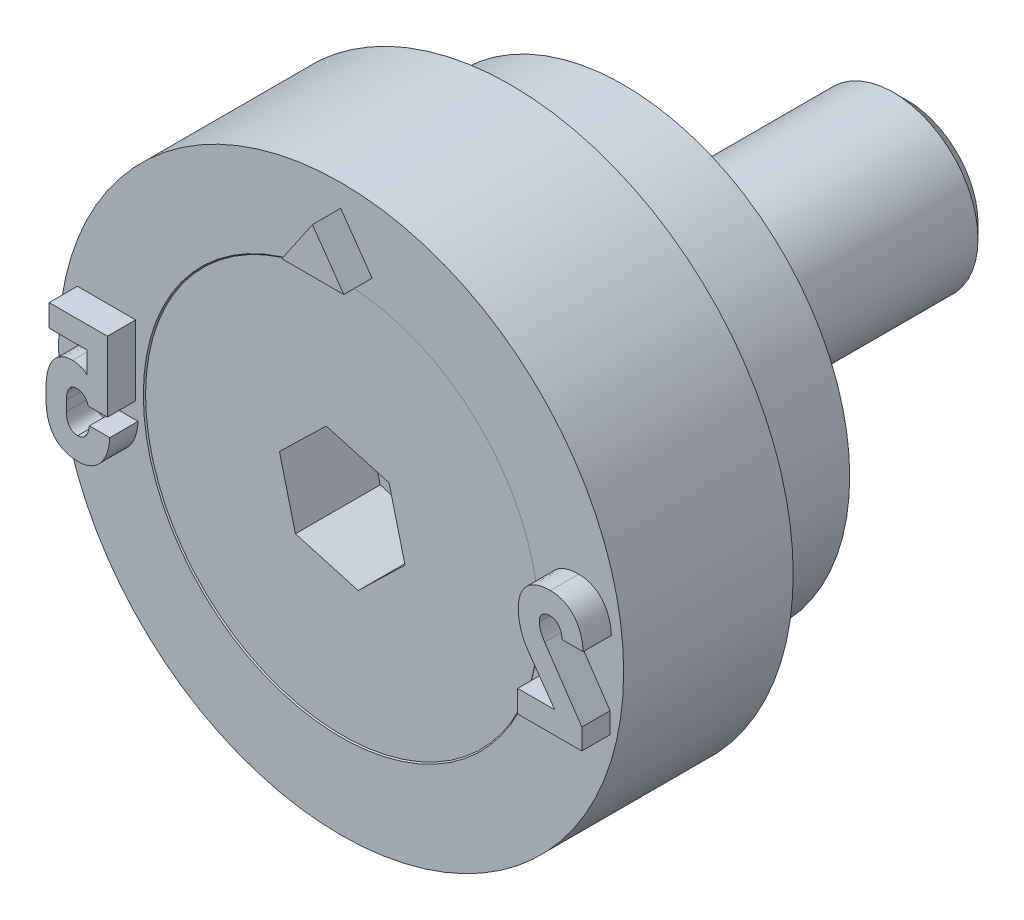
ISO-10303-21;
HEADER;
FILE_DESCRIPTION(('STEP AP214'),'2;1');
FILE_NAME('part.step','',(''),(''),'','','');
FILE_SCHEMA(('AUTOMOTIVE_DESIGN { 1 0 10303 214 1 1 1 1 }'));
ENDSEC;
DATA;
#1=APPLICATION_CONTEXT('core data for automotive mechanical design processes');
#2=APPLICATION_PROTOCOL_DEFINITION('international standard','automotive_design',2000,#1);
#3=PRODUCT_CONTEXT('',#1,'mechanical');
#4=PRODUCT('Part','Part','',(#3));
#5=PRODUCT_RELATED_PRODUCT_CATEGORY('part','',(#4));
#6=PRODUCT_DEFINITION_FORMATION('','',#4);
#7=PRODUCT_DEFINITION_CONTEXT('part definition',#1,'design');
#8=PRODUCT_DEFINITION('design','',#6,#7);
#9=PRODUCT_DEFINITION_SHAPE('','',#8);
#10=(LENGTH_UNIT() NAMED_UNIT(*) SI_UNIT(.MILLI.,.METRE.));
#11=(NAMED_UNIT(*) PLANE_ANGLE_UNIT() SI_UNIT($,.RADIAN.));
#12=(NAMED_UNIT(*) SI_UNIT($,.STERADIAN.) SOLID_ANGLE_UNIT());
#13=UNCERTAINTY_MEASURE_WITH_UNIT(LENGTH_MEASURE(1.E-05),#10,'distance_accuracy_value','');
#14=(GEOMETRIC_REPRESENTATION_CONTEXT(3) GLOBAL_UNCERTAINTY_ASSIGNED_CONTEXT((#13)) GLOBAL_UNIT_ASSIGNED_CONTEXT((#10,
#11,#12)) REPRESENTATION_CONTEXT('',''));
#15=CARTESIAN_POINT('',(0.,0.,0.));
#16=DIRECTION('',(0.,0.,1.));
#17=DIRECTION('',(1.,0.,0.));
#18=AXIS2_PLACEMENT_3D('',#15,#16,#17);
#19=CARTESIAN_POINT('',(0.,0.,-0.0200000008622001));
#20=DIRECTION('',(0.,0.,1.));
#21=DIRECTION('',(1.,0.,0.));
#22=AXIS2_PLACEMENT_3D('',#19,#20,#21);
#23=CYLINDRICAL_SURFACE('',#22,1.5);
#24=CARTESIAN_POINT('',(0.,0.,-2.0000000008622));
#25=DIRECTION('',(0.,0.,1.));
#26=DIRECTION('',(1.,0.,0.));
#27=AXIS2_PLACEMENT_3D('',#24,#25,#26);
#28=CIRCLE('',#27,1.5);
#29=CARTESIAN_POINT('',(1.5,0.,-2.0000000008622));
#30=VERTEX_POINT('',#29);
#31=EDGE_CURVE('E12',#30,#30,#28,.T.);
#32=ORIENTED_EDGE('',*,*,#31,.F.);
#33=EDGE_LOOP('',(#32));
#34=FACE_BOUND('',#33,.T.);
#35=CARTESIAN_POINT('',(0.,0.,-9.7700000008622));
#36=DIRECTION('',(0.,0.,1.));
#37=DIRECTION('',(1.,0.,0.));
#38=AXIS2_PLACEMENT_3D('',#35,#36,#37);
#39=CIRCLE('',#38,1.5);
#40=CARTESIAN_POINT('',(1.5,0.,-9.7700000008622));
#41=VERTEX_POINT('',#40);
#42=EDGE_CURVE('E146',#41,#41,#39,.T.);
#43=ORIENTED_EDGE('',*,*,#42,.T.);
#44=EDGE_LOOP('',(#43));
#45=FACE_BOUND('',#44,.T.);
#46=ADVANCED_FACE('F45',(#34,#45),#23,.T.);
#47=CARTESIAN_POINT('',(0.,0.,-2.0000000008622));
#48=DIRECTION('',(0.,0.,1.));
#49=DIRECTION('',(1.,0.,0.));
#50=AXIS2_PLACEMENT_3D('',#47,#48,#49);
#51=CONICAL_SURFACE('',#50,1.5,0.785398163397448);
#52=CARTESIAN_POINT('',(0.,0.,-0.0200000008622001));
#53=DIRECTION('',(0.,0.,1.));
#54=DIRECTION('',(1.,0.,0.));
#55=AXIS2_PLACEMENT_3D('',#52,#53,#54);
#56=CIRCLE('',#55,3.48);
#57=CARTESIAN_POINT('',(3.48,0.,-0.0200000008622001));
#58=VERTEX_POINT('',#57);
#59=EDGE_CURVE('E52',#58,#58,#56,.T.);
#60=ORIENTED_EDGE('',*,*,#59,.F.);
#61=EDGE_LOOP('',(#60));
#62=FACE_BOUND('',#61,.T.);
#63=ORIENTED_EDGE('',*,*,#31,.T.);
#64=EDGE_LOOP('',(#63));
#65=FACE_BOUND('',#64,.T.);
#66=ADVANCED_FACE('F161',(#62,#65),#51,.T.);
#67=CARTESIAN_POINT('',(0.,3.48,-0.0200000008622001));
#68=DIRECTION('',(0.,0.,-1.));
#69=DIRECTION('',(-1.,0.,0.));
#70=AXIS2_PLACEMENT_3D('',#67,#68,#69);
#71=PLANE('',#70);
#72=DIRECTION('',(0.962144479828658,-0.272539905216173,0.));
#73=VECTOR('',#72,1.);
#74=CARTESIAN_POINT('',(-0.828034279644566,-0.804793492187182,-0.0200000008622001));
#75=LINE('',#74,#73);
#76=CARTESIAN_POINT('',(-0.828034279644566,-0.804793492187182,-0.0200000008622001));
#77=VERTEX_POINT('',#76);
#78=CARTESIAN_POINT('',(0.282954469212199,-1.11949546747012,-0.0200000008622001));
#79=VERTEX_POINT('',#78);
#80=EDGE_CURVE('E133',#77,#79,#75,.T.);
#81=ORIENTED_EDGE('',*,*,#80,.F.);
#82=DIRECTION('',(0.245045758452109,-0.969511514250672,0.));
#83=VECTOR('',#82,1.);
#84=CARTESIAN_POINT('',(-1.11098874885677,0.314701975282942,-0.0200000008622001));
#85=LINE('',#84,#83);
#86=CARTESIAN_POINT('',(-1.11098874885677,0.314701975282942,-0.0200000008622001));
#87=VERTEX_POINT('',#86);
#88=EDGE_CURVE('E59',#87,#77,#85,.T.);
#89=ORIENTED_EDGE('',*,*,#88,.F.);
#90=DIRECTION('',(-0.717098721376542,-0.696971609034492,0.));
#91=VECTOR('',#90,1.);
#92=CARTESIAN_POINT('',(-0.282954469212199,1.11949546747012,-0.0200000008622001));
#93=LINE('',#92,#91);
#94=CARTESIAN_POINT('',(-0.282954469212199,1.11949546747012,-0.0200000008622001));
#95=VERTEX_POINT('',#94);
#96=EDGE_CURVE('E142',#95,#87,#93,.T.);
#97=ORIENTED_EDGE('',*,*,#96,.F.);
#98=DIRECTION('',(-0.962144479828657,0.272539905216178,0.));
#99=VECTOR('',#98,1.);
#100=CARTESIAN_POINT('',(0.828034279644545,0.804793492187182,-0.0200000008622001));
#101=LINE('',#100,#99);
#102=CARTESIAN_POINT('',(0.828034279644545,0.804793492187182,-0.0200000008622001));
#103=VERTEX_POINT('',#102);
#104=EDGE_CURVE('E140',#103,#95,#101,.T.);
#105=ORIENTED_EDGE('',*,*,#104,.F.);
#106=DIRECTION('',(-0.245045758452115,0.96951151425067,0.));
#107=VECTOR('',#106,1.);
#108=CARTESIAN_POINT('',(1.11098874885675,-0.314701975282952,-0.0200000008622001));
#109=LINE('',#108,#107);
#110=CARTESIAN_POINT('',(1.11098874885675,-0.314701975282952,-0.0200000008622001));
#111=VERTEX_POINT('',#110);
#112=EDGE_CURVE('E107',#111,#103,#109,.T.);
#113=ORIENTED_EDGE('',*,*,#112,.F.);
#114=DIRECTION('',(0.717098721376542,0.696971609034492,0.));
#115=VECTOR('',#114,1.);
#116=CARTESIAN_POINT('',(0.282954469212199,-1.11949546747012,-0.0200000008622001));
#117=LINE('',#116,#115);
#118=EDGE_CURVE('E136',#79,#111,#117,.T.);
#119=ORIENTED_EDGE('',*,*,#118,.F.);
#120=EDGE_LOOP('',(#81,#89,#97,#105,#113,#119));
#121=FACE_BOUND('',#120,.T.);
#122=ORIENTED_EDGE('',*,*,#59,.T.);
#123=EDGE_LOOP('',(#122));
#124=FACE_BOUND('',#123,.T.);
#125=ADVANCED_FACE('F159',(#121,#124),#71,.F.);
#126=CARTESIAN_POINT('',(0.,0.,-10.0200000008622));
#127=DIRECTION('',(0.,0.,1.));
#128=DIRECTION('',(1.,0.,0.));
#129=AXIS2_PLACEMENT_3D('',#126,#127,#128);
#130=PLANE('',#129);
#131=CARTESIAN_POINT('',(0.,0.,-10.0200000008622));
#132=DIRECTION('',(0.,0.,1.));
#133=DIRECTION('',(1.,0.,0.));
#134=AXIS2_PLACEMENT_3D('',#131,#132,#133);
#135=CIRCLE('',#134,1.25);
#136=CARTESIAN_POINT('',(1.25,0.,-10.0200000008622));
#137=VERTEX_POINT('',#136);
#138=EDGE_CURVE('E154',#137,#137,#135,.T.);
#139=ORIENTED_EDGE('',*,*,#138,.F.);
#140=EDGE_LOOP('',(#139));
#141=FACE_BOUND('',#140,.T.);
#142=ADVANCED_FACE('F174',(#141),#130,.F.);
#143=CARTESIAN_POINT('',(0.,0.,-10.0200000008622));
#144=DIRECTION('',(0.,0.,1.));
#145=DIRECTION('',(1.,0.,0.));
#146=AXIS2_PLACEMENT_3D('',#143,#144,#145);
#147=CONICAL_SURFACE('',#146,1.25,0.78539816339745);
#148=ORIENTED_EDGE('',*,*,#42,.F.);
#149=EDGE_LOOP('',(#148));
#150=FACE_BOUND('',#149,.T.);
#151=ORIENTED_EDGE('',*,*,#138,.T.);
#152=EDGE_LOOP('',(#151));
#153=FACE_BOUND('',#152,.T.);
#154=ADVANCED_FACE('F170',(#150,#153),#147,.T.);
#155=CARTESIAN_POINT('',(-1.11098874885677,0.314701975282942,-1.5200000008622));
#156=DIRECTION('',(-0.969511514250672,-0.245045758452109,0.));
#157=DIRECTION('',(0.245045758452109,-0.969511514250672,0.));
#158=AXIS2_PLACEMENT_3D('',#155,#156,#157);
#159=PLANE('',#158);
#160=ORIENTED_EDGE('',*,*,#88,.T.);
#161=DIRECTION('',(0.,0.,1.));
#162=VECTOR('',#161,1.);
#163=CARTESIAN_POINT('',(-0.828034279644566,-0.804793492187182,-1.5200000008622));
#164=LINE('',#163,#162);
#165=CARTESIAN_POINT('',(-0.828034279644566,-0.804793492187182,-1.5200000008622));
#166=VERTEX_POINT('',#165);
#167=EDGE_CURVE('E89',#166,#77,#164,.T.);
#168=ORIENTED_EDGE('',*,*,#167,.F.);
#169=DIRECTION('',(0.245045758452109,-0.969511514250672,0.));
#170=VECTOR('',#169,1.);
#171=CARTESIAN_POINT('',(-1.11098874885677,0.314701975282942,-1.5200000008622));
#172=LINE('',#171,#170);
#173=CARTESIAN_POINT('',(-1.11098874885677,0.314701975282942,-1.5200000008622));
#174=VERTEX_POINT('',#173);
#175=EDGE_CURVE('E144',#174,#166,#172,.T.);
#176=ORIENTED_EDGE('',*,*,#175,.F.);
#177=DIRECTION('',(0.,0.,1.));
#178=VECTOR('',#177,1.);
#179=CARTESIAN_POINT('',(-1.11098874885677,0.314701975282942,-1.5200000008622));
#180=LINE('',#179,#178);
#181=EDGE_CURVE('E67',#174,#87,#180,.T.);
#182=ORIENTED_EDGE('',*,*,#181,.T.);
#183=EDGE_LOOP('',(#160,#168,#176,#182));
#184=FACE_BOUND('',#183,.T.);
#185=ADVANCED_FACE('F173',(#184),#159,.F.);
#186=CARTESIAN_POINT('',(-0.282954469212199,1.11949546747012,-1.5200000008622));
#187=DIRECTION('',(-0.696971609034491,0.717098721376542,0.));
#188=DIRECTION('',(-0.717098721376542,-0.696971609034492,0.));
#189=AXIS2_PLACEMENT_3D('',#186,#187,#188);
#190=PLANE('',#189);
#191=ORIENTED_EDGE('',*,*,#96,.T.);
#192=ORIENTED_EDGE('',*,*,#181,.F.);
#193=DIRECTION('',(-0.717098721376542,-0.696971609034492,0.));
#194=VECTOR('',#193,1.);
#195=CARTESIAN_POINT('',(-0.282954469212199,1.11949546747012,-1.5200000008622));
#196=LINE('',#195,#194);
#197=CARTESIAN_POINT('',(-0.282954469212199,1.11949546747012,-1.5200000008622));
#198=VERTEX_POINT('',#197);
#199=EDGE_CURVE('E119',#198,#174,#196,.T.);
#200=ORIENTED_EDGE('',*,*,#199,.F.);
#201=DIRECTION('',(0.,0.,1.));
#202=VECTOR('',#201,1.);
#203=CARTESIAN_POINT('',(-0.282954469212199,1.11949546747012,-1.5200000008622));
#204=LINE('',#203,#202);
#205=EDGE_CURVE('E111',#198,#95,#204,.T.);
#206=ORIENTED_EDGE('',*,*,#205,.T.);
#207=EDGE_LOOP('',(#191,#192,#200,#206));
#208=FACE_BOUND('',#207,.T.);
#209=ADVANCED_FACE('F188',(#208),#190,.F.);
#210=CARTESIAN_POINT('',(0.828034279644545,0.804793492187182,-1.5200000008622));
#211=DIRECTION('',(0.272539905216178,0.962144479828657,0.));
#212=DIRECTION('',(-0.962144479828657,0.272539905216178,0.));
#213=AXIS2_PLACEMENT_3D('',#210,#211,#212);
#214=PLANE('',#213);
#215=ORIENTED_EDGE('',*,*,#104,.T.);
#216=ORIENTED_EDGE('',*,*,#205,.F.);
#217=DIRECTION('',(-0.962144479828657,0.272539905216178,0.));
#218=VECTOR('',#217,1.);
#219=CARTESIAN_POINT('',(0.828034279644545,0.804793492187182,-1.5200000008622));
#220=LINE('',#219,#218);
#221=CARTESIAN_POINT('',(0.828034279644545,0.804793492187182,-1.5200000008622));
#222=VERTEX_POINT('',#221);
#223=EDGE_CURVE('E115',#222,#198,#220,.T.);
#224=ORIENTED_EDGE('',*,*,#223,.F.);
#225=DIRECTION('',(0.,0.,1.));
#226=VECTOR('',#225,1.);
#227=CARTESIAN_POINT('',(0.828034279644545,0.804793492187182,-1.5200000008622));
#228=LINE('',#227,#226);
#229=EDGE_CURVE('E100',#222,#103,#228,.T.);
#230=ORIENTED_EDGE('',*,*,#229,.T.);
#231=EDGE_LOOP('',(#215,#216,#224,#230));
#232=FACE_BOUND('',#231,.T.);
#233=ADVANCED_FACE('F116',(#232),#214,.F.);
#234=CARTESIAN_POINT('',(1.11098874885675,-0.314701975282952,-1.5200000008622));
#235=DIRECTION('',(0.96951151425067,0.245045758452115,0.));
#236=DIRECTION('',(-0.245045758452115,0.96951151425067,0.));
#237=AXIS2_PLACEMENT_3D('',#234,#235,#236);
#238=PLANE('',#237);
#239=ORIENTED_EDGE('',*,*,#112,.T.);
#240=ORIENTED_EDGE('',*,*,#229,.F.);
#241=DIRECTION('',(-0.245045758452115,0.96951151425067,0.));
#242=VECTOR('',#241,1.);
#243=CARTESIAN_POINT('',(1.11098874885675,-0.314701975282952,-1.5200000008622));
#244=LINE('',#243,#242);
#245=CARTESIAN_POINT('',(1.11098874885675,-0.314701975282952,-1.5200000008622));
#246=VERTEX_POINT('',#245);
#247=EDGE_CURVE('E104',#246,#222,#244,.T.);
#248=ORIENTED_EDGE('',*,*,#247,.F.);
#249=DIRECTION('',(0.,0.,1.));
#250=VECTOR('',#249,1.);
#251=CARTESIAN_POINT('',(1.11098874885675,-0.314701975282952,-1.5200000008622));
#252=LINE('',#251,#250);
#253=EDGE_CURVE('E112',#246,#111,#252,.T.);
#254=ORIENTED_EDGE('',*,*,#253,.T.);
#255=EDGE_LOOP('',(#239,#240,#248,#254));
#256=FACE_BOUND('',#255,.T.);
#257=ADVANCED_FACE('F102',(#256),#238,.F.);
#258=CARTESIAN_POINT('',(0.282954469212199,-1.11949546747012,-1.5200000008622));
#259=DIRECTION('',(0.696971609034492,-0.717098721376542,0.));
#260=DIRECTION('',(0.717098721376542,0.696971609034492,0.));
#261=AXIS2_PLACEMENT_3D('',#258,#259,#260);
#262=PLANE('',#261);
#263=ORIENTED_EDGE('',*,*,#118,.T.);
#264=ORIENTED_EDGE('',*,*,#253,.F.);
#265=DIRECTION('',(0.717098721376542,0.696971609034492,0.));
#266=VECTOR('',#265,1.);
#267=CARTESIAN_POINT('',(0.282954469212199,-1.11949546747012,-1.5200000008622));
#268=LINE('',#267,#266);
#269=CARTESIAN_POINT('',(0.282954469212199,-1.11949546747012,-1.5200000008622));
#270=VERTEX_POINT('',#269);
#271=EDGE_CURVE('E125',#270,#246,#268,.T.);
#272=ORIENTED_EDGE('',*,*,#271,.F.);
#273=DIRECTION('',(0.,0.,1.));
#274=VECTOR('',#273,1.);
#275=CARTESIAN_POINT('',(0.282954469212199,-1.11949546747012,-1.5200000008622));
#276=LINE('',#275,#274);
#277=EDGE_CURVE('E149',#270,#79,#276,.T.);
#278=ORIENTED_EDGE('',*,*,#277,.T.);
#279=EDGE_LOOP('',(#263,#264,#272,#278));
#280=FACE_BOUND('',#279,.T.);
#281=ADVANCED_FACE('F192',(#280),#262,.F.);
#282=CARTESIAN_POINT('',(-0.828034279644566,-0.804793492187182,-1.5200000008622));
#283=DIRECTION('',(-0.272539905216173,-0.962144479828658,0.));
#284=DIRECTION('',(0.962144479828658,-0.272539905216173,0.));
#285=AXIS2_PLACEMENT_3D('',#282,#283,#284);
#286=PLANE('',#285);
#287=ORIENTED_EDGE('',*,*,#80,.T.);
#288=ORIENTED_EDGE('',*,*,#277,.F.);
#289=DIRECTION('',(0.962144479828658,-0.272539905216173,0.));
#290=VECTOR('',#289,1.);
#291=CARTESIAN_POINT('',(-0.828034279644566,-0.804793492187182,-1.5200000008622));
#292=LINE('',#291,#290);
#293=EDGE_CURVE('E127',#166,#270,#292,.T.);
#294=ORIENTED_EDGE('',*,*,#293,.F.);
#295=ORIENTED_EDGE('',*,*,#167,.T.);
#296=EDGE_LOOP('',(#287,#288,#294,#295));
#297=FACE_BOUND('',#296,.T.);
#298=ADVANCED_FACE('F189',(#297),#286,.F.);
#299=CARTESIAN_POINT('',(0.,0.,-1.5200000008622));
#300=DIRECTION('',(0.,0.,1.));
#301=DIRECTION('',(1.,0.,0.));
#302=AXIS2_PLACEMENT_3D('',#299,#300,#301);
#303=PLANE('',#302);
#304=ORIENTED_EDGE('',*,*,#175,.T.);
#305=ORIENTED_EDGE('',*,*,#293,.T.);
#306=ORIENTED_EDGE('',*,*,#271,.T.);
#307=ORIENTED_EDGE('',*,*,#247,.T.);
#308=ORIENTED_EDGE('',*,*,#223,.T.);
#309=ORIENTED_EDGE('',*,*,#199,.T.);
#310=EDGE_LOOP('',(#304,#305,#306,#307,#308,#309));
#311=FACE_BOUND('',#310,.T.);
#312=ADVANCED_FACE('F122',(#311),#303,.T.);
#313=CLOSED_SHELL('',(#46,#66,#125,#142,#154,#185,#209,#233,#257,#281,#298,#312));
#314=MANIFOLD_SOLID_BREP('B2',#313);
#315=CARTESIAN_POINT('',(0.,0.,3.12219627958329));
#316=DIRECTION('',(0.,0.,1.));
#317=DIRECTION('',(1.,0.,0.));
#318=AXIS2_PLACEMENT_3D('',#315,#316,#317);
#319=CYLINDRICAL_SURFACE('',#318,5.);
#320=CARTESIAN_POINT('',(0.,0.,0.));
#321=DIRECTION('',(0.,0.,1.));
#322=DIRECTION('',(1.,0.,0.));
#323=AXIS2_PLACEMENT_3D('',#320,#321,#322);
#324=CIRCLE('',#323,5.);
#325=CARTESIAN_POINT('',(5.,0.,0.));
#326=VERTEX_POINT('',#325);
#327=EDGE_CURVE('E950',#326,#326,#324,.T.);
#328=ORIENTED_EDGE('',*,*,#327,.F.);
#329=EDGE_LOOP('',(#328));
#330=FACE_BOUND('',#329,.T.);
#331=CARTESIAN_POINT('',(0.,0.,-3.));
#332=DIRECTION('',(0.,0.,1.));
#333=DIRECTION('',(1.,0.,0.));
#334=AXIS2_PLACEMENT_3D('',#331,#332,#333);
#335=CIRCLE('',#334,5.);
#336=CARTESIAN_POINT('',(5.,0.,-3.));
#337=VERTEX_POINT('',#336);
#338=EDGE_CURVE('E1603',#337,#337,#335,.T.);
#339=ORIENTED_EDGE('',*,*,#338,.T.);
#340=EDGE_LOOP('',(#339));
#341=FACE_BOUND('',#340,.T.);
#342=ADVANCED_FACE('F281',(#330,#341),#319,.T.);
#343=CARTESIAN_POINT('',(0.,5.,0.));
#344=DIRECTION('',(0.,0.,-1.));
#345=DIRECTION('',(-1.,0.,0.));
#346=AXIS2_PLACEMENT_3D('',#343,#344,#345);
#347=PLANE('',#346);
#348=DIRECTION('',(0.,-1.,0.));
#349=VECTOR('',#348,1.);
#350=CARTESIAN_POINT('',(-3.59318121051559,5.,0.));
#351=LINE('',#350,#349);
#352=CARTESIAN_POINT('',(-3.59318121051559,-0.454283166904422,0.));
#353=VERTEX_POINT('',#352);
#354=CARTESIAN_POINT('',(-3.59318121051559,-0.455603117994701,0.));
#355=VERTEX_POINT('',#354);
#356=EDGE_CURVE('E290',#353,#355,#351,.T.);
#357=ORIENTED_EDGE('',*,*,#356,.T.);
#358=CARTESIAN_POINT('',(-4.15548037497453,-1.10193916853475,0.));
#359=CARTESIAN_POINT('',(-4.13032347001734,-1.10106349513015,0.));
#360=CARTESIAN_POINT('',(-4.08089442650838,-1.099342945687,0.));
#361=CARTESIAN_POINT('',(-4.00884491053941,-1.08410505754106,0.));
#362=CARTESIAN_POINT('',(-3.94043187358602,-1.06046176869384,0.));
#363=CARTESIAN_POINT('',(-3.87636882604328,-1.02680221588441,0.));
#364=CARTESIAN_POINT('',(-3.81743000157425,-0.983898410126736,0.));
#365=CARTESIAN_POINT('',(-3.7648069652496,-0.931661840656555,0.));
#366=CARTESIAN_POINT('',(-3.71774458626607,-0.871303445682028,0.));
#367=CARTESIAN_POINT('',(-3.67743720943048,-0.802319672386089,0.));
#368=CARTESIAN_POINT('',(-3.64377445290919,-0.725650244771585,0.));
#369=CARTESIAN_POINT('',(-3.61941119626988,-0.641352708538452,0.));
#370=CARTESIAN_POINT('',(-3.6006257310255,-0.550918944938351,0.));
#371=CARTESIAN_POINT('',(-3.59570858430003,-0.487962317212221,0.));
#372=CARTESIAN_POINT('',(-3.59318121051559,-0.455603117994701,0.));
#373=B_SPLINE_CURVE_WITH_KNOTS('',3,(#358,#359,#360,#361,#362,#363,#364,#365,#366,#367,#368,
#369,#370,#371,#372),.UNSPECIFIED.,.F.,.F.,(4,1,1,1,1,1,1,1,1,1,1,1,4),(0.,0.0790734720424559,
0.15536593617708,0.23067372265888,0.306220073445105,0.382183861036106,0.459194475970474,
0.538764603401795,0.622339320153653,0.709959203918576,0.801497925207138,0.897971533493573,1.),.UNSPECIFIED.);
#374=CARTESIAN_POINT('',(-4.15548037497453,-1.10193916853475,0.));
#375=VERTEX_POINT('',#374);
#376=EDGE_CURVE('E43',#355,#375,#373,.F.);
#377=ORIENTED_EDGE('',*,*,#376,.T.);
#378=CARTESIAN_POINT('',(-4.7217393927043,-0.439323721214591,0.));
#379=CARTESIAN_POINT('',(-4.72112791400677,-0.472958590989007,0.));
#380=CARTESIAN_POINT('',(-4.71994551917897,-0.537997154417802,0.));
#381=CARTESIAN_POINT('',(-4.70668378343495,-0.631668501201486,0.));
#382=CARTESIAN_POINT('',(-4.68662537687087,-0.71824121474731,0.));
#383=CARTESIAN_POINT('',(-4.65694862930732,-0.796735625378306,0.));
#384=CARTESIAN_POINT('',(-4.6202453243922,-0.867336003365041,0.));
#385=CARTESIAN_POINT('',(-4.57520405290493,-0.92911845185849,0.));
#386=CARTESIAN_POINT('',(-4.52240308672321,-0.981800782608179,0.));
#387=CARTESIAN_POINT('',(-4.46254771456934,-1.02600960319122,0.));
#388=CARTESIAN_POINT('',(-4.39506305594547,-1.06002139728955,0.));
#389=CARTESIAN_POINT('',(-4.32116143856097,-1.08467976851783,0.));
#390=CARTESIAN_POINT('',(-4.24039145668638,-1.09940897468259,0.));
#391=CARTESIAN_POINT('',(-4.18443580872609,-1.10107634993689,0.));
#392=CARTESIAN_POINT('',(-4.15548037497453,-1.10193916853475,0.));
#393=B_SPLINE_CURVE_WITH_KNOTS('',3,(#378,#379,#380,#381,#382,#383,#384,#385,#386,#387,#388,
#389,#390,#391,#392),.UNSPECIFIED.,.F.,.F.,(4,1,1,1,1,1,1,1,1,1,1,1,4),(0.,0.101974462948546,
0.197184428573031,0.286436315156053,0.371064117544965,0.451078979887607,0.527172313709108,
0.602055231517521,0.676545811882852,0.75196617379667,0.830341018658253,0.912206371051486,1.),.UNSPECIFIED.);
#394=CARTESIAN_POINT('',(-4.7217393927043,-0.439323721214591,0.));
#395=VERTEX_POINT('',#394);
#396=EDGE_CURVE('E1033',#375,#395,#393,.F.);
#397=ORIENTED_EDGE('',*,*,#396,.T.);
#398=DIRECTION('',(0.,1.,0.));
#399=VECTOR('',#398,1.);
#400=CARTESIAN_POINT('',(-4.7217393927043,5.,0.));
#401=LINE('',#400,#399);
#402=CARTESIAN_POINT('',(-4.7217393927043,-0.258490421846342,0.));
#403=VERTEX_POINT('',#402);
#404=EDGE_CURVE('E1038',#395,#403,#401,.T.);
#405=ORIENTED_EDGE('',*,*,#404,.T.);
#406=CARTESIAN_POINT('',(-4.24919690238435,0.402365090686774,0.));
#407=CARTESIAN_POINT('',(-4.2731768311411,0.401477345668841,0.));
#408=CARTESIAN_POINT('',(-4.31998741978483,0.399744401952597,0.));
#409=CARTESIAN_POINT('',(-4.38736095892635,0.385046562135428,0.));
#410=CARTESIAN_POINT('',(-4.44931794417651,0.360454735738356,0.));
#411=CARTESIAN_POINT('',(-4.50566260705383,0.326232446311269,0.));
#412=CARTESIAN_POINT('',(-4.55627370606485,0.282736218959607,0.));
#413=CARTESIAN_POINT('',(-4.6001391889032,0.229886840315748,0.));
#414=CARTESIAN_POINT('',(-4.63786157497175,0.168465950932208,0.));
#415=CARTESIAN_POINT('',(-4.66825704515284,0.0981014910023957,0.));
#416=CARTESIAN_POINT('',(-4.69232453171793,0.0197271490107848,0.));
#417=CARTESIAN_POINT('',(-4.70985232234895,-0.0662921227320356,0.));
#418=CARTESIAN_POINT('',(-4.71974452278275,-0.159995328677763,0.));
#419=CARTESIAN_POINT('',(-4.72105869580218,-0.224881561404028,0.));
#420=CARTESIAN_POINT('',(-4.7217393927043,-0.258490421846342,0.));
#421=B_SPLINE_CURVE_WITH_KNOTS('',3,(#406,#407,#408,#409,#410,#411,#412,#413,#414,#415,#416,
#417,#418,#419,#420),.UNSPECIFIED.,.F.,.F.,(4,1,1,1,1,1,1,1,1,1,1,1,4),(0.,0.0784325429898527,
0.153106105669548,0.224426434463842,0.295728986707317,0.367902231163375,0.441850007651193,
0.519661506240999,0.603065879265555,0.692049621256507,0.787616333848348,0.889992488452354,1.),.UNSPECIFIED.);
#422=CARTESIAN_POINT('',(-4.24919690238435,0.402365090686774,0.));
#423=VERTEX_POINT('',#422);
#424=EDGE_CURVE('E1044',#403,#423,#421,.F.);
#425=ORIENTED_EDGE('',*,*,#424,.T.);
#426=CARTESIAN_POINT('',(-3.99708624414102,0.306008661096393,0.));
#427=CARTESIAN_POINT('',(-4.00439079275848,0.313248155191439,0.));
#428=CARTESIAN_POINT('',(-4.01930977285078,0.32803426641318,0.));
#429=CARTESIAN_POINT('',(-4.0455766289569,0.346894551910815,0.));
#430=CARTESIAN_POINT('',(-4.07547924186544,0.363280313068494,0.));
#431=CARTESIAN_POINT('',(-4.11967520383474,0.381562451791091,0.));
#432=CARTESIAN_POINT('',(-4.17782198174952,0.398217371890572,0.));
#433=CARTESIAN_POINT('',(-4.22575741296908,0.401002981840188,0.));
#434=CARTESIAN_POINT('',(-4.24919690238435,0.402365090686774,0.));
#435=B_SPLINE_CURVE_WITH_KNOTS('',3,(#426,#427,#428,#429,#430,#431,#432,#433,#434),
.UNSPECIFIED.,.F.,.F.,(4,1,1,1,1,1,4),(0.,0.111406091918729,0.227538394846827,0.349287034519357,
0.480459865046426,0.745955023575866,1.),.UNSPECIFIED.);
#436=CARTESIAN_POINT('',(-3.99708624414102,0.306008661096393,0.));
#437=VERTEX_POINT('',#436);
#438=EDGE_CURVE('E1049',#423,#437,#435,.F.);
#439=ORIENTED_EDGE('',*,*,#438,.T.);
#440=DIRECTION('',(0.,1.,0.));
#441=VECTOR('',#440,1.);
#442=CARTESIAN_POINT('',(-3.99708624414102,5.,0.));
#443=LINE('',#442,#441);
#444=CARTESIAN_POINT('',(-3.99708624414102,0.68747452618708,0.));
#445=VERTEX_POINT('',#444);
#446=EDGE_CURVE('E1057',#437,#445,#443,.T.);
#447=ORIENTED_EDGE('',*,*,#446,.T.);
#448=DIRECTION('',(-1.,0.,0.));
#449=VECTOR('',#448,1.);
#450=CARTESIAN_POINT('',(0.,0.68747452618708,0.));
#451=LINE('',#450,#449);
#452=CARTESIAN_POINT('',(-4.66630144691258,0.68747452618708,0.));
#453=VERTEX_POINT('',#452);
#454=EDGE_CURVE('E1063',#445,#453,#451,.T.);
#455=ORIENTED_EDGE('',*,*,#454,.T.);
#456=DIRECTION('',(0.,1.,0.));
#457=VECTOR('',#456,1.);
#458=CARTESIAN_POINT('',(-4.66630144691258,5.,0.));
#459=LINE('',#458,#457);
#460=CARTESIAN_POINT('',(-4.66630144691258,1.0795,0.));
#461=VERTEX_POINT('',#460);
#462=EDGE_CURVE('E1066',#453,#461,#459,.T.);
#463=ORIENTED_EDGE('',*,*,#462,.T.);
#464=DIRECTION('',(1.,0.,0.));
#465=VECTOR('',#464,1.);
#466=CARTESIAN_POINT('',(0.,1.0795,0.));
#467=LINE('',#466,#465);
#468=CARTESIAN_POINT('',(-3.63541964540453,1.0795,0.));
#469=VERTEX_POINT('',#468);
#470=EDGE_CURVE('E1069',#461,#469,#467,.T.);
#471=ORIENTED_EDGE('',*,*,#470,.T.);
#472=DIRECTION('',(0.,-1.,0.));
#473=VECTOR('',#472,1.);
#474=CARTESIAN_POINT('',(-3.63541964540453,5.,0.));
#475=LINE('',#474,#473);
#476=CARTESIAN_POINT('',(-3.63541964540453,-0.161694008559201,0.));
#477=VERTEX_POINT('',#476);
#478=EDGE_CURVE('E1072',#469,#477,#475,.T.);
#479=ORIENTED_EDGE('',*,*,#478,.T.);
#480=DIRECTION('',(-1.,0.,0.));
#481=VECTOR('',#480,1.);
#482=CARTESIAN_POINT('',(0.,-0.161694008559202,0.));
#483=LINE('',#482,#481);
#484=CARTESIAN_POINT('',(-3.973327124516,-0.161694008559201,0.));
#485=VERTEX_POINT('',#484);
#486=EDGE_CURVE('E1075',#477,#485,#483,.T.);
#487=ORIENTED_EDGE('',*,*,#486,.T.);
#488=CARTESIAN_POINT('',(-4.18187939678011,0.00769971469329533,0.));
#489=CARTESIAN_POINT('',(-4.16936534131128,0.00725055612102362,0.));
#490=CARTESIAN_POINT('',(-4.14491861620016,0.00637310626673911,0.));
#491=CARTESIAN_POINT('',(-4.10970790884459,-0.00218654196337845,0.));
#492=CARTESIAN_POINT('',(-4.07740049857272,-0.0165357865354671,0.));
#493=CARTESIAN_POINT('',(-4.04829852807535,-0.0363461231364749,0.));
#494=CARTESIAN_POINT('',(-4.02318495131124,-0.0613514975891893,0.));
#495=CARTESIAN_POINT('',(-4.00153951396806,-0.0903446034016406,0.));
#496=CARTESIAN_POINT('',(-3.98479525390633,-0.124291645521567,0.));
#497=CARTESIAN_POINT('',(-3.97723285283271,-0.148955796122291,0.));
#498=CARTESIAN_POINT('',(-3.973327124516,-0.161694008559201,0.));
#499=B_SPLINE_CURVE_WITH_KNOTS('',3,(#488,#489,#490,#491,#492,#493,#494,#495,#496,#497,#498),
.UNSPECIFIED.,.F.,.F.,(4,1,1,1,1,1,1,1,4),(0.,0.128801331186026,0.251618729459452,
0.370714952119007,0.49145921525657,0.612241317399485,0.734377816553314,0.862814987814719,1.),.UNSPECIFIED.);
#500=CARTESIAN_POINT('',(-4.18187939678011,0.00769971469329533,0.));
#501=VERTEX_POINT('',#500);
#502=EDGE_CURVE('E1078',#485,#501,#499,.F.);
#503=ORIENTED_EDGE('',*,*,#502,.T.);
#504=CARTESIAN_POINT('',(-4.3600727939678,-0.258490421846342,0.));
#505=CARTESIAN_POINT('',(-4.35951491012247,-0.238361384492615,0.));
#506=CARTESIAN_POINT('',(-4.35845826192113,-0.200236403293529,0.));
#507=CARTESIAN_POINT('',(-4.34981713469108,-0.146796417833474,0.));
#508=CARTESIAN_POINT('',(-4.33558087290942,-0.100343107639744,0.));
#509=CARTESIAN_POINT('',(-4.31482353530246,-0.0617299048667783,0.));
#510=CARTESIAN_POINT('',(-4.28926537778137,-0.0303216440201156,0.));
#511=CARTESIAN_POINT('',(-4.25786697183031,-0.00792819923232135,0.));
#512=CARTESIAN_POINT('',(-4.22130422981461,0.00535304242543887,0.));
#513=CARTESIAN_POINT('',(-4.19533724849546,0.00689866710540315,0.));
#514=CARTESIAN_POINT('',(-4.18187939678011,0.00769971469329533,0.));
#515=B_SPLINE_CURVE_WITH_KNOTS('',3,(#504,#505,#506,#507,#508,#509,#510,#511,#512,#513,#514),
.UNSPECIFIED.,.F.,.F.,(4,1,1,1,1,1,1,1,4),(0.,0.167644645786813,0.317523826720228,
0.449701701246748,0.570546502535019,0.680704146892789,0.784127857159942,0.888120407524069,1.),.UNSPECIFIED.);
#516=CARTESIAN_POINT('',(-4.3600727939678,-0.258490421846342,0.));
#517=VERTEX_POINT('',#516);
#518=EDGE_CURVE('E1083',#501,#517,#515,.F.);
#519=ORIENTED_EDGE('',*,*,#518,.T.);
#520=DIRECTION('',(0.,-1.,0.));
#521=VECTOR('',#520,1.);
#522=CARTESIAN_POINT('',(-4.3600727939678,5.,0.));
#523=LINE('',#522,#521);
#524=CARTESIAN_POINT('',(-4.3600727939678,-0.439323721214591,0.));
#525=VERTEX_POINT('',#524);
#526=EDGE_CURVE('E1091',#517,#525,#523,.T.);
#527=ORIENTED_EDGE('',*,*,#526,.T.);
#528=CARTESIAN_POINT('',(-4.16076017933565,-0.706833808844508,0.));
#529=CARTESIAN_POINT('',(-4.17583095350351,-0.70607760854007,0.));
#530=CARTESIAN_POINT('',(-4.20485189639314,-0.704621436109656,0.));
#531=CARTESIAN_POINT('',(-4.24548252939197,-0.690934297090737,0.));
#532=CARTESIAN_POINT('',(-4.28065960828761,-0.668727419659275,0.));
#533=CARTESIAN_POINT('',(-4.30965850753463,-0.637370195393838,0.));
#534=CARTESIAN_POINT('',(-4.33251153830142,-0.598130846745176,0.));
#535=CARTESIAN_POINT('',(-4.34852178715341,-0.551334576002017,0.));
#536=CARTESIAN_POINT('',(-4.35881560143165,-0.497701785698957,0.));
#537=CARTESIAN_POINT('',(-4.35963895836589,-0.45946899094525,0.));
#538=CARTESIAN_POINT('',(-4.3600727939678,-0.439323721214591,0.));
#539=B_SPLINE_CURVE_WITH_KNOTS('',3,(#528,#529,#530,#531,#532,#533,#534,#535,#536,#537,#538),
.UNSPECIFIED.,.F.,.F.,(4,1,1,1,1,1,1,1,4),(0.,0.119678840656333,0.230458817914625,
0.337035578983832,0.447729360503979,0.567088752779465,0.695988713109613,0.839813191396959,1.),.UNSPECIFIED.);
#540=CARTESIAN_POINT('',(-4.16076017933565,-0.706833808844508,0.));
#541=VERTEX_POINT('',#540);
#542=EDGE_CURVE('E1097',#525,#541,#539,.F.);
#543=ORIENTED_EDGE('',*,*,#542,.T.);
#544=CARTESIAN_POINT('',(-3.95484780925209,-0.455603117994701,0.));
#545=CARTESIAN_POINT('',(-3.95695900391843,-0.474470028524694,0.));
#546=CARTESIAN_POINT('',(-3.96096827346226,-0.510299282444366,0.));
#547=CARTESIAN_POINT('',(-3.97493952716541,-0.56028452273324,0.));
#548=CARTESIAN_POINT('',(-3.99361995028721,-0.603984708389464,0.));
#549=CARTESIAN_POINT('',(-4.01787583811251,-0.640933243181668,0.));
#550=CARTESIAN_POINT('',(-4.04694202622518,-0.670902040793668,0.));
#551=CARTESIAN_POINT('',(-4.08158727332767,-0.69126958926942,0.));
#552=CARTESIAN_POINT('',(-4.11970893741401,-0.705029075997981,0.));
#553=CARTESIAN_POINT('',(-4.1468496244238,-0.70622226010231,0.));
#554=CARTESIAN_POINT('',(-4.16076017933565,-0.706833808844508,0.));
#555=B_SPLINE_CURVE_WITH_KNOTS('',3,(#544,#545,#546,#547,#548,#549,#550,#551,#552,#553,#554),
.UNSPECIFIED.,.F.,.F.,(4,1,1,1,1,1,1,1,4),(0.,0.157927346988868,0.299912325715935,
0.430666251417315,0.552318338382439,0.66635750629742,0.774897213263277,0.884626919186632,1.),.UNSPECIFIED.);
#556=CARTESIAN_POINT('',(-3.95484780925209,-0.455603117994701,0.));
#557=VERTEX_POINT('',#556);
#558=EDGE_CURVE('E1102',#541,#557,#555,.F.);
#559=ORIENTED_EDGE('',*,*,#558,.T.);
#560=DIRECTION('',(0.,1.,0.));
#561=VECTOR('',#560,1.);
#562=CARTESIAN_POINT('',(-3.95484780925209,5.,0.));
#563=LINE('',#562,#561);
#564=CARTESIAN_POINT('',(-3.95484780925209,-0.454283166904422,0.));
#565=VERTEX_POINT('',#564);
#566=EDGE_CURVE('E1110',#557,#565,#563,.T.);
#567=ORIENTED_EDGE('',*,*,#566,.T.);
#568=DIRECTION('',(1.,0.,0.));
#569=VECTOR('',#568,1.);
#570=CARTESIAN_POINT('',(0.,-0.454283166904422,0.));
#571=LINE('',#570,#569);
#572=EDGE_CURVE('E1116',#565,#353,#571,.T.);
#573=ORIENTED_EDGE('',*,*,#572,.T.);
#574=EDGE_LOOP('',(#357,#377,#397,#405,#425,#439,#447,#455,#463,#471,#479,#487,#503,#519,#527,
#543,#559,#567,#573));
#575=FACE_BOUND('',#574,.T.);
#576=CARTESIAN_POINT('',(4.10098968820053,0.26157030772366,0.));
#577=CARTESIAN_POINT('',(4.08711782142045,0.283206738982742,0.));
#578=CARTESIAN_POINT('',(4.0598552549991,0.325729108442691,0.));
#579=CARTESIAN_POINT('',(4.03579825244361,0.383457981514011,0.));
#580=CARTESIAN_POINT('',(4.02042127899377,0.428894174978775,0.));
#581=CARTESIAN_POINT('',(4.01338456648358,0.461868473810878,0.));
#582=CARTESIAN_POINT('',(4.00782554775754,0.493402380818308,0.));
#583=CARTESIAN_POINT('',(4.00745485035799,0.514097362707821,0.));
#584=CARTESIAN_POINT('',(4.00727316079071,0.524240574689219,0.));
#585=B_SPLINE_CURVE_WITH_KNOTS('',3,(#576,#577,#578,#579,#580,#581,#582,#583,#584),
.UNSPECIFIED.,.F.,.F.,(4,1,1,1,1,1,4),(0.,0.272236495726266,0.535030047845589,0.661020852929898,
0.780702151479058,0.892515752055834,1.),.UNSPECIFIED.);
#586=CARTESIAN_POINT('',(4.00727316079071,0.524240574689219,0.));
#587=VERTEX_POINT('',#586);
#588=CARTESIAN_POINT('',(4.10098968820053,0.26157030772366,0.));
#589=VERTEX_POINT('',#588);
#590=EDGE_CURVE('E941',#587,#589,#585,.F.);
#591=ORIENTED_EDGE('',*,*,#590,.T.);
#592=DIRECTION('',(0.560128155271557,-0.828405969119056,0.));
#593=VECTOR('',#592,1.);
#594=CARTESIAN_POINT('',(0.615635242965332,5.41626285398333,0.));
#595=LINE('',#594,#593);
#596=CARTESIAN_POINT('',(4.75964528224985,-0.712553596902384,0.));
#597=VERTEX_POINT('',#596);
#598=EDGE_CURVE('E1028',#589,#597,#595,.T.);
#599=ORIENTED_EDGE('',*,*,#598,.T.);
#600=DIRECTION('',(0.,-1.,0.));
#601=VECTOR('',#600,1.);
#602=CARTESIAN_POINT('',(4.75964528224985,5.,0.));
#603=LINE('',#602,#601);
#604=CARTESIAN_POINT('',(4.75964528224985,-1.0795,0.));
#605=VERTEX_POINT('',#604);
#606=EDGE_CURVE('E951',#597,#605,#603,.T.);
#607=ORIENTED_EDGE('',*,*,#606,.T.);
#608=DIRECTION('',(-1.,0.,0.));
#609=VECTOR('',#608,1.);
#610=CARTESIAN_POINT('',(0.,-1.0795,0.));
#611=LINE('',#610,#609);
#612=CARTESIAN_POINT('',(3.62448734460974,-1.0795,0.));
#613=VERTEX_POINT('',#612);
#614=EDGE_CURVE('E954',#605,#613,#611,.T.);
#615=ORIENTED_EDGE('',*,*,#614,.T.);
#616=DIRECTION('',(0.,1.,0.));
#617=VECTOR('',#616,1.);
#618=CARTESIAN_POINT('',(3.62448734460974,5.,0.));
#619=LINE('',#618,#617);
#620=CARTESIAN_POINT('',(3.62448734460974,-0.68747452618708,0.));
#621=VERTEX_POINT('',#620);
#622=EDGE_CURVE('E962',#613,#621,#619,.T.);
#623=ORIENTED_EDGE('',*,*,#622,.T.);
#624=DIRECTION('',(1.,0.,0.));
#625=VECTOR('',#624,1.);
#626=CARTESIAN_POINT('',(0.,-0.68747452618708,0.));
#627=LINE('',#626,#625);
#628=CARTESIAN_POINT('',(4.2805030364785,-0.68747452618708,0.));
#629=VERTEX_POINT('',#628);
#630=EDGE_CURVE('E965',#621,#629,#627,.T.);
#631=ORIENTED_EDGE('',*,*,#630,.T.);
#632=DIRECTION('',(-0.575546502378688,0.817769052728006,0.));
#633=VECTOR('',#632,1.);
#634=CARTESIAN_POINT('',(0.185680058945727,5.13068177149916,0.));
#635=LINE('',#634,#633);
#636=CARTESIAN_POINT('',(3.80796054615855,-0.0160594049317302,0.));
#637=VERTEX_POINT('',#636);
#638=EDGE_CURVE('E968',#629,#637,#635,.T.);
#639=ORIENTED_EDGE('',*,*,#638,.T.);
#640=CARTESIAN_POINT('',(3.63504695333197,0.537440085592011,0.));
#641=CARTESIAN_POINT('',(3.63547137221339,0.512917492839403,0.));
#642=CARTESIAN_POINT('',(3.63632044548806,0.463858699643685,0.));
#643=CARTESIAN_POINT('',(3.64581587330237,0.390679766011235,0.));
#644=CARTESIAN_POINT('',(3.65956512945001,0.31761093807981,0.));
#645=CARTESIAN_POINT('',(3.68008126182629,0.245575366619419,0.));
#646=CARTESIAN_POINT('',(3.70468903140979,0.175156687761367,0.));
#647=CARTESIAN_POINT('',(3.73455808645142,0.107954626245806,0.));
#648=CARTESIAN_POINT('',(3.76802416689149,0.0437144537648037,0.));
#649=CARTESIAN_POINT('',(3.79468507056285,0.00381035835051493,0.));
#650=CARTESIAN_POINT('',(3.80796054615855,-0.0160594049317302,0.));
#651=B_SPLINE_CURVE_WITH_KNOTS('',3,(#640,#641,#642,#643,#644,#645,#646,#647,#648,#649,#650),
.UNSPECIFIED.,.F.,.F.,(4,1,1,1,1,1,1,1,4),(0.,0.124932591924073,0.249934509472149,
0.375589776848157,0.503650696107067,0.631337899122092,0.755525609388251,0.878266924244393,1.),.UNSPECIFIED.);
#652=CARTESIAN_POINT('',(3.63504695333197,0.537440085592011,0.));
#653=VERTEX_POINT('',#652);
#654=EDGE_CURVE('E971',#637,#653,#651,.F.);
#655=ORIENTED_EDGE('',*,*,#654,.T.);
#656=DIRECTION('',(0.,1.,0.));
#657=VECTOR('',#656,1.);
#658=CARTESIAN_POINT('',(3.63504695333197,5.,0.));
#659=LINE('',#658,#657);
#660=CARTESIAN_POINT('',(3.63504695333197,0.53920002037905,0.));
#661=VERTEX_POINT('',#660);
#662=EDGE_CURVE('E976',#653,#661,#659,.T.);
#663=ORIENTED_EDGE('',*,*,#662,.T.);
#664=CARTESIAN_POINT('',(4.20262592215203,1.10193916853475,0.));
#665=CARTESIAN_POINT('',(4.17368500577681,1.10127983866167,0.));
#666=CARTESIAN_POINT('',(4.11786545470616,1.10000816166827,0.));
#667=CARTESIAN_POINT('',(4.03737632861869,1.08742105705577,0.));
#668=CARTESIAN_POINT('',(3.96335454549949,1.06698832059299,0.));
#669=CARTESIAN_POINT('',(3.89591026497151,1.03788598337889,0.));
#670=CARTESIAN_POINT('',(3.83569019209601,1.00069718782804,0.));
#671=CARTESIAN_POINT('',(3.78239739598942,0.956276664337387,0.));
#672=CARTESIAN_POINT('',(3.73710347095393,0.903795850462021,0.));
#673=CARTESIAN_POINT('',(3.70012239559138,0.843593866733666,0.));
#674=CARTESIAN_POINT('',(3.67036324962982,0.776974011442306,0.));
#675=CARTESIAN_POINT('',(3.65005595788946,0.703247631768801,0.));
#676=CARTESIAN_POINT('',(3.63687857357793,0.623418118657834,0.));
#677=CARTESIAN_POINT('',(3.63567015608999,0.567854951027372,0.));
#678=CARTESIAN_POINT('',(3.63504695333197,0.53920002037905,0.));
#679=B_SPLINE_CURVE_WITH_KNOTS('',3,(#664,#665,#666,#667,#668,#669,#670,#671,#672,#673,#674,
#675,#676,#677,#678),.UNSPECIFIED.,.F.,.F.,(4,1,1,1,1,1,1,1,1,1,1,1,4),(0.,0.0954946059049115,
0.184184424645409,0.268193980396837,0.348437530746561,0.425843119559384,0.50111232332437,
0.576641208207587,0.653635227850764,0.733630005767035,0.816707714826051,0.905472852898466,1.),.UNSPECIFIED.);
#680=CARTESIAN_POINT('',(4.20262592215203,1.10193916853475,0.));
#681=VERTEX_POINT('',#680);
#682=EDGE_CURVE('E982',#661,#681,#679,.F.);
#683=ORIENTED_EDGE('',*,*,#682,.T.);
#684=CARTESIAN_POINT('',(4.78340440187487,0.456043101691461,0.));
#685=CARTESIAN_POINT('',(4.78087077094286,0.488547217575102,0.));
#686=CARTESIAN_POINT('',(4.77594099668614,0.551791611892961,0.));
#687=CARTESIAN_POINT('',(4.75729413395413,0.64240553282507,0.));
#688=CARTESIAN_POINT('',(4.7328286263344,0.726555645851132,0.));
#689=CARTESIAN_POINT('',(4.69899743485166,0.802826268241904,0.));
#690=CARTESIAN_POINT('',(4.65890696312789,0.872011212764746,0.));
#691=CARTESIAN_POINT('',(4.61095803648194,0.9320943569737,0.));
#692=CARTESIAN_POINT('',(4.55712458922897,0.984177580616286,0.));
#693=CARTESIAN_POINT('',(4.49655366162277,1.0269815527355,0.));
#694=CARTESIAN_POINT('',(4.43004497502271,1.06049424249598,0.));
#695=CARTESIAN_POINT('',(4.35862770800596,1.08500574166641,0.));
#696=CARTESIAN_POINT('',(4.2820891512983,1.09918070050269,0.));
#697=CARTESIAN_POINT('',(4.22952343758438,1.10100545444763,0.));
#698=CARTESIAN_POINT('',(4.20262592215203,1.10193916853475,0.));
#699=B_SPLINE_CURVE_WITH_KNOTS('',3,(#684,#685,#686,#687,#688,#689,#690,#691,#692,#693,#694,
#695,#696,#697,#698),.UNSPECIFIED.,.F.,.F.,(4,1,1,1,1,1,1,1,1,1,1,1,4),(0.,0.100707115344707,
0.195949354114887,0.285463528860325,0.371145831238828,0.453268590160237,0.532017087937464,
0.608024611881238,0.684141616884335,0.76039087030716,0.837538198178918,0.916869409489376,1.),.UNSPECIFIED.);
#700=CARTESIAN_POINT('',(4.78340440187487,0.456043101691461,0.));
#701=VERTEX_POINT('',#700);
#702=EDGE_CURVE('E987',#681,#701,#699,.F.);
#703=ORIENTED_EDGE('',*,*,#702,.T.);
#704=DIRECTION('',(0.,-1.,0.));
#705=VECTOR('',#704,1.);
#706=CARTESIAN_POINT('',(4.78340440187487,5.,0.));
#707=LINE('',#706,#705);
#708=CARTESIAN_POINT('',(4.78340440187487,0.454283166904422,0.));
#709=VERTEX_POINT('',#708);
#710=EDGE_CURVE('E995',#701,#709,#707,.T.);
#711=ORIENTED_EDGE('',*,*,#710,.T.);
#712=DIRECTION('',(-1.,0.,0.));
#713=VECTOR('',#712,1.);
#714=CARTESIAN_POINT('',(0.,0.454283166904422,0.));
#715=LINE('',#714,#713);
#716=CARTESIAN_POINT('',(4.41249814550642,0.454283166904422,0.));
#717=VERTEX_POINT('',#716);
#718=EDGE_CURVE('E1001',#709,#717,#715,.T.);
#719=ORIENTED_EDGE('',*,*,#718,.T.);
#720=DIRECTION('',(0.,1.,0.));
#721=VECTOR('',#720,1.);
#722=CARTESIAN_POINT('',(4.41249814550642,5.,0.));
#723=LINE('',#722,#721);
#724=CARTESIAN_POINT('',(4.41249814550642,0.456043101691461,0.));
#725=VERTEX_POINT('',#724);
#726=EDGE_CURVE('E1004',#717,#725,#723,.T.);
#727=ORIENTED_EDGE('',*,*,#726,.T.);
#728=CARTESIAN_POINT('',(4.19998601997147,0.709913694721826,0.));
#729=CARTESIAN_POINT('',(4.21431413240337,0.709257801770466,0.));
#730=CARTESIAN_POINT('',(4.24208465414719,0.707986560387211,0.));
#731=CARTESIAN_POINT('',(4.28154574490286,0.695008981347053,0.));
#732=CARTESIAN_POINT('',(4.31670204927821,0.673922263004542,0.));
#733=CARTESIAN_POINT('',(4.34679978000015,0.644113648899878,0.));
#734=CARTESIAN_POINT('',(4.37212128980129,0.607126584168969,0.));
#735=CARTESIAN_POINT('',(4.39115068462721,0.562802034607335,0.));
#736=CARTESIAN_POINT('',(4.40546061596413,0.511906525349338,0.));
#737=CARTESIAN_POINT('',(4.41006596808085,0.475349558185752,0.));
#738=CARTESIAN_POINT('',(4.41249814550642,0.456043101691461,0.));
#739=B_SPLINE_CURVE_WITH_KNOTS('',3,(#728,#729,#730,#731,#732,#733,#734,#735,#736,#737,#738),
.UNSPECIFIED.,.F.,.F.,(4,1,1,1,1,1,1,1,4),(0.,0.116724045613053,0.226232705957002,
0.335347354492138,0.448891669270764,0.569535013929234,0.699344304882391,0.841217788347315,1.),.UNSPECIFIED.);
#740=CARTESIAN_POINT('',(4.19998601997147,0.709913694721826,0.));
#741=VERTEX_POINT('',#740);
#742=EDGE_CURVE('E1007',#725,#741,#739,.F.);
#743=ORIENTED_EDGE('',*,*,#742,.T.);
#744=CARTESIAN_POINT('',(4.00727316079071,0.527320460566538,0.));
#745=CARTESIAN_POINT('',(4.00779787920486,0.541160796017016,0.));
#746=CARTESIAN_POINT('',(4.00879379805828,0.567429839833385,0.));
#747=CARTESIAN_POINT('',(4.01807070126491,0.604541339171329,0.));
#748=CARTESIAN_POINT('',(4.0342186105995,0.636514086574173,0.));
#749=CARTESIAN_POINT('',(4.05651139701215,0.663478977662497,0.));
#750=CARTESIAN_POINT('',(4.08500025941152,0.684451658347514,0.));
#751=CARTESIAN_POINT('',(4.1187083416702,0.699570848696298,0.));
#752=CARTESIAN_POINT('',(4.1577567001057,0.708270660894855,0.));
#753=CARTESIAN_POINT('',(4.18542149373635,0.709347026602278,0.));
#754=CARTESIAN_POINT('',(4.19998601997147,0.709913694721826,0.));
#755=B_SPLINE_CURVE_WITH_KNOTS('',3,(#744,#745,#746,#747,#748,#749,#750,#751,#752,#753,#754),
.UNSPECIFIED.,.F.,.F.,(4,1,1,1,1,1,1,1,4),(0.,0.137390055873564,0.260767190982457,
0.376796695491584,0.490635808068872,0.605200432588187,0.725225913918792,0.855341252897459,1.),.UNSPECIFIED.);
#756=CARTESIAN_POINT('',(4.00727316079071,0.527320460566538,0.));
#757=VERTEX_POINT('',#756);
#758=EDGE_CURVE('E1012',#741,#757,#755,.F.);
#759=ORIENTED_EDGE('',*,*,#758,.T.);
#760=DIRECTION('',(0.,-1.,0.));
#761=VECTOR('',#760,1.);
#762=CARTESIAN_POINT('',(4.00727316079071,5.,0.));
#763=LINE('',#762,#761);
#764=EDGE_CURVE('E1020',#757,#587,#763,.T.);
#765=ORIENTED_EDGE('',*,*,#764,.T.);
#766=EDGE_LOOP('',(#591,#599,#607,#615,#623,#631,#639,#655,#663,#683,#703,#711,#719,#727,#743,
#759,#765));
#767=FACE_BOUND('',#766,.T.);
#768=DIRECTION('',(-0.573576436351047,0.819152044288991,0.));
#769=VECTOR('',#768,1.);
#770=CARTESIAN_POINT('',(0.548658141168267,3.81,0.));
#771=LINE('',#770,#769);
#772=CARTESIAN_POINT('',(0.548658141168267,3.81,0.));
#773=VERTEX_POINT('',#772);
#774=CARTESIAN_POINT('',(-0.00713159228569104,4.60375,0.));
#775=VERTEX_POINT('',#774);
#776=EDGE_CURVE('E540',#773,#775,#771,.T.);
#777=ORIENTED_EDGE('',*,*,#776,.F.);
#778=DIRECTION('',(1.,0.,0.));
#779=VECTOR('',#778,1.);
#780=CARTESIAN_POINT('',(-0.548658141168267,3.81,0.));
#781=LINE('',#780,#779);
#782=CARTESIAN_POINT('',(-0.548658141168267,3.81,0.));
#783=VERTEX_POINT('',#782);
#784=EDGE_CURVE('E893',#783,#773,#781,.T.);
#785=ORIENTED_EDGE('',*,*,#784,.F.);
#786=DIRECTION('',(-0.563573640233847,-0.826065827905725,0.));
#787=VECTOR('',#786,1.);
#788=CARTESIAN_POINT('',(-0.00713159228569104,4.60375,0.));
#789=LINE('',#788,#787);
#790=EDGE_CURVE('E1602',#775,#783,#789,.T.);
#791=ORIENTED_EDGE('',*,*,#790,.F.);
#792=EDGE_LOOP('',(#777,#785,#791));
#793=FACE_BOUND('',#792,.T.);
#794=CARTESIAN_POINT('',(0.,0.,0.));
#795=DIRECTION('',(0.,0.,1.));
#796=DIRECTION('',(1.,0.,0.));
#797=AXIS2_PLACEMENT_3D('',#794,#795,#796);
#798=CIRCLE('',#797,3.5000000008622);
#799=CARTESIAN_POINT('',(3.5000000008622,0.,0.));
#800=VERTEX_POINT('',#799);
#801=EDGE_CURVE('E947',#800,#800,#798,.T.);
#802=ORIENTED_EDGE('',*,*,#801,.F.);
#803=EDGE_LOOP('',(#802));
#804=FACE_BOUND('',#803,.T.);
#805=ORIENTED_EDGE('',*,*,#327,.T.);
#806=EDGE_LOOP('',(#805));
#807=FACE_BOUND('',#806,.T.);
#808=ADVANCED_FACE('F926',(#575,#767,#793,#804,#807),#347,.F.);
#809=CARTESIAN_POINT('',(0.,0.,0.));
#810=DIRECTION('',(0.,0.,1.));
#811=DIRECTION('',(1.,0.,0.));
#812=AXIS2_PLACEMENT_3D('',#809,#810,#811);
#813=CONICAL_SURFACE('',#812,3.5000000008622,0.785398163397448);
#814=CARTESIAN_POINT('',(0.,0.,-2.0000000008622));
#815=DIRECTION('',(0.,0.,1.));
#816=DIRECTION('',(1.,0.,0.));
#817=AXIS2_PLACEMENT_3D('',#814,#815,#816);
#818=CIRCLE('',#817,1.5);
#819=CARTESIAN_POINT('',(1.5,0.,-2.0000000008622));
#820=VERTEX_POINT('',#819);
#821=EDGE_CURVE('E956',#820,#820,#818,.T.);
#822=ORIENTED_EDGE('',*,*,#821,.F.);
#823=EDGE_LOOP('',(#822));
#824=FACE_BOUND('',#823,.T.);
#825=ORIENTED_EDGE('',*,*,#801,.T.);
#826=EDGE_LOOP('',(#825));
#827=FACE_BOUND('',#826,.T.);
#828=ADVANCED_FACE('F923',(#824,#827),#813,.F.);
#829=CARTESIAN_POINT('',(0.,0.,3.12219627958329));
#830=DIRECTION('',(0.,0.,1.));
#831=DIRECTION('',(1.,0.,0.));
#832=AXIS2_PLACEMENT_3D('',#829,#830,#831);
#833=CYLINDRICAL_SURFACE('',#832,1.5);
#834=CARTESIAN_POINT('',(0.,0.,-5.));
#835=DIRECTION('',(0.,0.,1.));
#836=DIRECTION('',(1.,0.,0.));
#837=AXIS2_PLACEMENT_3D('',#834,#835,#836);
#838=CIRCLE('',#837,1.5);
#839=CARTESIAN_POINT('',(1.5,0.,-5.));
#840=VERTEX_POINT('',#839);
#841=EDGE_CURVE('E1614',#840,#840,#838,.T.);
#842=ORIENTED_EDGE('',*,*,#841,.F.);
#843=EDGE_LOOP('',(#842));
#844=FACE_BOUND('',#843,.T.);
#845=ORIENTED_EDGE('',*,*,#821,.T.);
#846=EDGE_LOOP('',(#845));
#847=FACE_BOUND('',#846,.T.);
#848=ADVANCED_FACE('F919',(#844,#847),#833,.F.);
#849=CARTESIAN_POINT('',(0.,1.5,-5.));
#850=DIRECTION('',(0.,0.,1.));
#851=DIRECTION('',(1.,0.,0.));
#852=AXIS2_PLACEMENT_3D('',#849,#850,#851);
#853=PLANE('',#852);
#854=CARTESIAN_POINT('',(0.,0.,-5.));
#855=DIRECTION('',(0.,0.,1.));
#856=DIRECTION('',(1.,0.,0.));
#857=AXIS2_PLACEMENT_3D('',#854,#855,#856);
#858=CIRCLE('',#857,4.);
#859=CARTESIAN_POINT('',(4.,0.,-5.));
#860=VERTEX_POINT('',#859);
#861=EDGE_CURVE('E1611',#860,#860,#858,.T.);
#862=ORIENTED_EDGE('',*,*,#861,.F.);
#863=EDGE_LOOP('',(#862));
#864=FACE_BOUND('',#863,.T.);
#865=ORIENTED_EDGE('',*,*,#841,.T.);
#866=EDGE_LOOP('',(#865));
#867=FACE_BOUND('',#866,.T.);
#868=ADVANCED_FACE('F915',(#864,#867),#853,.F.);
#869=CARTESIAN_POINT('',(0.,0.,3.12219627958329));
#870=DIRECTION('',(0.,0.,1.));
#871=DIRECTION('',(1.,0.,0.));
#872=AXIS2_PLACEMENT_3D('',#869,#870,#871);
#873=CYLINDRICAL_SURFACE('',#872,4.);
#874=CARTESIAN_POINT('',(0.,0.,-3.));
#875=DIRECTION('',(0.,0.,1.));
#876=DIRECTION('',(1.,0.,0.));
#877=AXIS2_PLACEMENT_3D('',#874,#875,#876);
#878=CIRCLE('',#877,4.);
#879=CARTESIAN_POINT('',(4.,0.,-3.));
#880=VERTEX_POINT('',#879);
#881=EDGE_CURVE('E1608',#880,#880,#878,.T.);
#882=ORIENTED_EDGE('',*,*,#881,.F.);
#883=EDGE_LOOP('',(#882));
#884=FACE_BOUND('',#883,.T.);
#885=ORIENTED_EDGE('',*,*,#861,.T.);
#886=EDGE_LOOP('',(#885));
#887=FACE_BOUND('',#886,.T.);
#888=ADVANCED_FACE('F911',(#884,#887),#873,.T.);
#889=CARTESIAN_POINT('',(0.,4.,-3.));
#890=DIRECTION('',(0.,0.,1.));
#891=DIRECTION('',(1.,0.,0.));
#892=AXIS2_PLACEMENT_3D('',#889,#890,#891);
#893=PLANE('',#892);
#894=ORIENTED_EDGE('',*,*,#338,.F.);
#895=EDGE_LOOP('',(#894));
#896=FACE_BOUND('',#895,.T.);
#897=ORIENTED_EDGE('',*,*,#881,.T.);
#898=EDGE_LOOP('',(#897));
#899=FACE_BOUND('',#898,.T.);
#900=ADVANCED_FACE('F907',(#896,#899),#893,.F.);
#901=CARTESIAN_POINT('',(4.75964528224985,-0.712553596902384,-2.97017521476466));
#902=DIRECTION('',(0.828405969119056,0.560128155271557,0.));
#903=DIRECTION('',(-0.560128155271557,0.828405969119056,0.));
#904=AXIS2_PLACEMENT_3D('',#901,#902,#903);
#905=PLANE('',#904);
#906=ORIENTED_EDGE('',*,*,#598,.F.);
#907=DIRECTION('',(0.,0.,1.));
#908=VECTOR('',#907,1.);
#909=CARTESIAN_POINT('',(4.10098968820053,0.26157030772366,-2.97017521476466));
#910=LINE('',#909,#908);
#911=CARTESIAN_POINT('',(4.10098968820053,0.26157030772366,0.5));
#912=VERTEX_POINT('',#911);
#913=EDGE_CURVE('E1520',#589,#912,#910,.T.);
#914=ORIENTED_EDGE('',*,*,#913,.T.);
#915=DIRECTION('',(-0.560128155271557,0.828405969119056,0.));
#916=VECTOR('',#915,1.);
#917=CARTESIAN_POINT('',(4.75964528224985,-0.712553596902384,0.5));
#918=LINE('',#917,#916);
#919=CARTESIAN_POINT('',(4.75964528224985,-0.712553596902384,0.5));
#920=VERTEX_POINT('',#919);
#921=EDGE_CURVE('E1601',#920,#912,#918,.T.);
#922=ORIENTED_EDGE('',*,*,#921,.F.);
#923=DIRECTION('',(0.,0.,1.));
#924=VECTOR('',#923,1.);
#925=CARTESIAN_POINT('',(4.75964528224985,-0.712553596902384,-2.97017521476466));
#926=LINE('',#925,#924);
#927=EDGE_CURVE('E833',#597,#920,#926,.T.);
#928=ORIENTED_EDGE('',*,*,#927,.F.);
#929=EDGE_LOOP('',(#906,#914,#922,#928));
#930=FACE_BOUND('',#929,.T.);
#931=ADVANCED_FACE('F903',(#930),#905,.T.);
#932=CARTESIAN_POINT('',(4.10098968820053,0.26157030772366,-2.97017521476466));
#933=CARTESIAN_POINT('',(4.08711782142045,0.283206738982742,-2.97017521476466));
#934=CARTESIAN_POINT('',(4.0598552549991,0.325729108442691,-2.97017521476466));
#935=CARTESIAN_POINT('',(4.03579825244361,0.383457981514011,-2.97017521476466));
#936=CARTESIAN_POINT('',(4.02042127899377,0.428894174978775,-2.97017521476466));
#937=CARTESIAN_POINT('',(4.01338456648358,0.461868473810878,-2.97017521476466));
#938=CARTESIAN_POINT('',(4.00782554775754,0.493402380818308,-2.97017521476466));
#939=CARTESIAN_POINT('',(4.00745485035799,0.514097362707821,-2.97017521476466));
#940=CARTESIAN_POINT('',(4.00727316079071,0.524240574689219,-2.97017521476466));
#941=B_SPLINE_CURVE_WITH_KNOTS('',3,(#932,#933,#934,#935,#936,#937,#938,#939,#940),
.UNSPECIFIED.,.F.,.F.,(4,1,1,1,1,1,4),(0.,0.272236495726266,0.535030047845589,0.661020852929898,
0.780702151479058,0.892515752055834,1.),.UNSPECIFIED.);
#942=DIRECTION('',(0.,0.,1.));
#943=VECTOR('',#942,1.);
#944=SURFACE_OF_LINEAR_EXTRUSION('',#941,#943);
#945=ORIENTED_EDGE('',*,*,#590,.F.);
#946=DIRECTION('',(0.,0.,1.));
#947=VECTOR('',#946,1.);
#948=CARTESIAN_POINT('',(4.00727316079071,0.524240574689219,-2.97017521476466));
#949=LINE('',#948,#947);
#950=CARTESIAN_POINT('',(4.00727316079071,0.524240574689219,0.5));
#951=VERTEX_POINT('',#950);
#952=EDGE_CURVE('E1498',#587,#951,#949,.T.);
#953=ORIENTED_EDGE('',*,*,#952,.T.);
#954=CARTESIAN_POINT('',(4.10098968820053,0.26157030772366,0.5));
#955=CARTESIAN_POINT('',(4.08711782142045,0.283206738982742,0.5));
#956=CARTESIAN_POINT('',(4.0598552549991,0.325729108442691,0.5));
#957=CARTESIAN_POINT('',(4.03579825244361,0.383457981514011,0.5));
#958=CARTESIAN_POINT('',(4.02042127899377,0.428894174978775,0.5));
#959=CARTESIAN_POINT('',(4.01338456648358,0.461868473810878,0.5));
#960=CARTESIAN_POINT('',(4.00782554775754,0.493402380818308,0.5));
#961=CARTESIAN_POINT('',(4.00745485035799,0.514097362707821,0.5));
#962=CARTESIAN_POINT('',(4.00727316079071,0.524240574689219,0.5));
#963=B_SPLINE_CURVE_WITH_KNOTS('',3,(#954,#955,#956,#957,#958,#959,#960,#961,#962),
.UNSPECIFIED.,.F.,.F.,(4,1,1,1,1,1,4),(0.,0.272236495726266,0.535030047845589,0.661020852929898,
0.780702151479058,0.892515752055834,1.),.UNSPECIFIED.);
#964=EDGE_CURVE('E1630',#912,#951,#963,.T.);
#965=ORIENTED_EDGE('',*,*,#964,.F.);
#966=ORIENTED_EDGE('',*,*,#913,.F.);
#967=EDGE_LOOP('',(#945,#953,#965,#966));
#968=FACE_BOUND('',#967,.T.);
#969=ADVANCED_FACE('F899',(#968),#944,.T.);
#970=CARTESIAN_POINT('',(4.00727316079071,0.524240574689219,-2.97017521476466));
#971=DIRECTION('',(1.,0.,0.));
#972=DIRECTION('',(0.,0.,-1.));
#973=AXIS2_PLACEMENT_3D('',#970,#971,#972);
#974=PLANE('',#973);
#975=ORIENTED_EDGE('',*,*,#764,.F.);
#976=DIRECTION('',(0.,0.,1.));
#977=VECTOR('',#976,1.);
#978=CARTESIAN_POINT('',(4.00727316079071,0.527320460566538,-2.97017521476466));
#979=LINE('',#978,#977);
#980=CARTESIAN_POINT('',(4.00727316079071,0.527320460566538,0.5));
#981=VERTEX_POINT('',#980);
#982=EDGE_CURVE('E1496',#757,#981,#979,.T.);
#983=ORIENTED_EDGE('',*,*,#982,.T.);
#984=DIRECTION('',(0.,1.,0.));
#985=VECTOR('',#984,1.);
#986=CARTESIAN_POINT('',(4.00727316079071,0.524240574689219,0.5));
#987=LINE('',#986,#985);
#988=EDGE_CURVE('E1631',#951,#981,#987,.T.);
#989=ORIENTED_EDGE('',*,*,#988,.F.);
#990=ORIENTED_EDGE('',*,*,#952,.F.);
#991=EDGE_LOOP('',(#975,#983,#989,#990));
#992=FACE_BOUND('',#991,.T.);
#993=ADVANCED_FACE('F902',(#992),#974,.T.);
#994=CARTESIAN_POINT('',(4.00727316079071,0.527320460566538,-2.97017521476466));
#995=CARTESIAN_POINT('',(4.00779787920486,0.541160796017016,-2.97017521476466));
#996=CARTESIAN_POINT('',(4.00879379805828,0.567429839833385,-2.97017521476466));
#997=CARTESIAN_POINT('',(4.01807070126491,0.604541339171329,-2.97017521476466));
#998=CARTESIAN_POINT('',(4.0342186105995,0.636514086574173,-2.97017521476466));
#999=CARTESIAN_POINT('',(4.05651139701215,0.663478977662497,-2.97017521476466));
#1000=CARTESIAN_POINT('',(4.08500025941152,0.684451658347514,-2.97017521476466));
#1001=CARTESIAN_POINT('',(4.1187083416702,0.699570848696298,-2.97017521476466));
#1002=CARTESIAN_POINT('',(4.1577567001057,0.708270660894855,-2.97017521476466));
#1003=CARTESIAN_POINT('',(4.18542149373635,0.709347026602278,-2.97017521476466));
#1004=CARTESIAN_POINT('',(4.19998601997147,0.709913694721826,-2.97017521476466));
#1005=B_SPLINE_CURVE_WITH_KNOTS('',3,(#994,#995,#996,#997,#998,#999,#1000,#1001,#1002,#1003,
#1004),.UNSPECIFIED.,.F.,.F.,(4,1,1,1,1,1,1,1,4),(0.,0.137390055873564,0.260767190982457,
0.376796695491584,0.490635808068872,0.605200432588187,0.725225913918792,0.855341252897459,1.),.UNSPECIFIED.);
#1006=DIRECTION('',(0.,0.,1.));
#1007=VECTOR('',#1006,1.);
#1008=SURFACE_OF_LINEAR_EXTRUSION('',#1005,#1007);
#1009=ORIENTED_EDGE('',*,*,#758,.F.);
#1010=DIRECTION('',(0.,0.,1.));
#1011=VECTOR('',#1010,1.);
#1012=CARTESIAN_POINT('',(4.19998601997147,0.709913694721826,-2.97017521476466));
#1013=LINE('',#1012,#1011);
#1014=CARTESIAN_POINT('',(4.19998601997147,0.709913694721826,0.5));
#1015=VERTEX_POINT('',#1014);
#1016=EDGE_CURVE('E1503',#741,#1015,#1013,.T.);
#1017=ORIENTED_EDGE('',*,*,#1016,.T.);
#1018=CARTESIAN_POINT('',(4.00727316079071,0.527320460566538,0.5));
#1019=CARTESIAN_POINT('',(4.00779787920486,0.541160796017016,0.5));
#1020=CARTESIAN_POINT('',(4.00879379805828,0.567429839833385,0.5));
#1021=CARTESIAN_POINT('',(4.01807070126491,0.604541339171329,0.5));
#1022=CARTESIAN_POINT('',(4.0342186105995,0.636514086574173,0.5));
#1023=CARTESIAN_POINT('',(4.05651139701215,0.663478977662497,0.5));
#1024=CARTESIAN_POINT('',(4.08500025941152,0.684451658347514,0.5));
#1025=CARTESIAN_POINT('',(4.1187083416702,0.699570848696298,0.5));
#1026=CARTESIAN_POINT('',(4.1577567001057,0.708270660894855,0.5));
#1027=CARTESIAN_POINT('',(4.18542149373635,0.709347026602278,0.5));
#1028=CARTESIAN_POINT('',(4.19998601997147,0.709913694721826,0.5));
#1029=B_SPLINE_CURVE_WITH_KNOTS('',3,(#1018,#1019,#1020,#1021,#1022,#1023,#1024,#1025,#1026,
#1027,#1028),.UNSPECIFIED.,.F.,.F.,(4,1,1,1,1,1,1,1,4),(0.,0.137390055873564,0.260767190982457,
0.376796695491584,0.490635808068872,0.605200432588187,0.725225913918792,0.855341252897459,1.),.UNSPECIFIED.);
#1030=EDGE_CURVE('E1502',#981,#1015,#1029,.T.);
#1031=ORIENTED_EDGE('',*,*,#1030,.F.);
#1032=ORIENTED_EDGE('',*,*,#982,.F.);
#1033=EDGE_LOOP('',(#1009,#1017,#1031,#1032));
#1034=FACE_BOUND('',#1033,.T.);
#1035=ADVANCED_FACE('F872',(#1034),#1008,.T.);
#1036=CARTESIAN_POINT('',(4.19998601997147,0.709913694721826,-2.97017521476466));
#1037=CARTESIAN_POINT('',(4.21431413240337,0.709257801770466,-2.97017521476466));
#1038=CARTESIAN_POINT('',(4.24208465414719,0.707986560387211,-2.97017521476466));
#1039=CARTESIAN_POINT('',(4.28154574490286,0.695008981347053,-2.97017521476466));
#1040=CARTESIAN_POINT('',(4.31670204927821,0.673922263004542,-2.97017521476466));
#1041=CARTESIAN_POINT('',(4.34679978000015,0.644113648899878,-2.97017521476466));
#1042=CARTESIAN_POINT('',(4.37212128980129,0.607126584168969,-2.97017521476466));
#1043=CARTESIAN_POINT('',(4.39115068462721,0.562802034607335,-2.97017521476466));
#1044=CARTESIAN_POINT('',(4.40546061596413,0.511906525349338,-2.97017521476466));
#1045=CARTESIAN_POINT('',(4.41006596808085,0.475349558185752,-2.97017521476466));
#1046=CARTESIAN_POINT('',(4.41249814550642,0.456043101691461,-2.97017521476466));
#1047=B_SPLINE_CURVE_WITH_KNOTS('',3,(#1036,#1037,#1038,#1039,#1040,#1041,#1042,#1043,#1044,
#1045,#1046),.UNSPECIFIED.,.F.,.F.,(4,1,1,1,1,1,1,1,4),(0.,0.116724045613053,0.226232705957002,
0.335347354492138,0.448891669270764,0.569535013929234,0.699344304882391,0.841217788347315,1.),.UNSPECIFIED.);
#1048=DIRECTION('',(0.,0.,1.));
#1049=VECTOR('',#1048,1.);
#1050=SURFACE_OF_LINEAR_EXTRUSION('',#1047,#1049);
#1051=ORIENTED_EDGE('',*,*,#742,.F.);
#1052=DIRECTION('',(0.,0.,1.));
#1053=VECTOR('',#1052,1.);
#1054=CARTESIAN_POINT('',(4.41249814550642,0.456043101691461,-2.97017521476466));
#1055=LINE('',#1054,#1053);
#1056=CARTESIAN_POINT('',(4.41249814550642,0.456043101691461,0.5));
#1057=VERTEX_POINT('',#1056);
#1058=EDGE_CURVE('E1507',#725,#1057,#1055,.T.);
#1059=ORIENTED_EDGE('',*,*,#1058,.T.);
#1060=CARTESIAN_POINT('',(4.19998601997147,0.709913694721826,0.5));
#1061=CARTESIAN_POINT('',(4.21431413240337,0.709257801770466,0.5));
#1062=CARTESIAN_POINT('',(4.24208465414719,0.707986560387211,0.5));
#1063=CARTESIAN_POINT('',(4.28154574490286,0.695008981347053,0.5));
#1064=CARTESIAN_POINT('',(4.31670204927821,0.673922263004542,0.5));
#1065=CARTESIAN_POINT('',(4.34679978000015,0.644113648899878,0.5));
#1066=CARTESIAN_POINT('',(4.37212128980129,0.607126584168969,0.5));
#1067=CARTESIAN_POINT('',(4.39115068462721,0.562802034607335,0.5));
#1068=CARTESIAN_POINT('',(4.40546061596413,0.511906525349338,0.5));
#1069=CARTESIAN_POINT('',(4.41006596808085,0.475349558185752,0.5));
#1070=CARTESIAN_POINT('',(4.41249814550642,0.456043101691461,0.5));
#1071=B_SPLINE_CURVE_WITH_KNOTS('',3,(#1060,#1061,#1062,#1063,#1064,#1065,#1066,#1067,#1068,
#1069,#1070),.UNSPECIFIED.,.F.,.F.,(4,1,1,1,1,1,1,1,4),(0.,0.116724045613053,0.226232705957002,
0.335347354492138,0.448891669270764,0.569535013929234,0.699344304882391,0.841217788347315,1.),.UNSPECIFIED.);
#1072=EDGE_CURVE('E1643',#1015,#1057,#1071,.T.);
#1073=ORIENTED_EDGE('',*,*,#1072,.F.);
#1074=ORIENTED_EDGE('',*,*,#1016,.F.);
#1075=EDGE_LOOP('',(#1051,#1059,#1073,#1074));
#1076=FACE_BOUND('',#1075,.T.);
#1077=ADVANCED_FACE('F868',(#1076),#1050,.T.);
#1078=CARTESIAN_POINT('',(4.41249814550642,0.456043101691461,-2.97017521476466));
#1079=DIRECTION('',(-1.,0.,0.));
#1080=DIRECTION('',(0.,0.,1.));
#1081=AXIS2_PLACEMENT_3D('',#1078,#1079,#1080);
#1082=PLANE('',#1081);
#1083=ORIENTED_EDGE('',*,*,#726,.F.);
#1084=DIRECTION('',(0.,0.,1.));
#1085=VECTOR('',#1084,1.);
#1086=CARTESIAN_POINT('',(4.41249814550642,0.454283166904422,-2.97017521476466));
#1087=LINE('',#1086,#1085);
#1088=CARTESIAN_POINT('',(4.41249814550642,0.454283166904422,0.5));
#1089=VERTEX_POINT('',#1088);
#1090=EDGE_CURVE('E1513',#717,#1089,#1087,.T.);
#1091=ORIENTED_EDGE('',*,*,#1090,.T.);
#1092=DIRECTION('',(0.,-1.,0.));
#1093=VECTOR('',#1092,1.);
#1094=CARTESIAN_POINT('',(4.41249814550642,0.456043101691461,0.5));
#1095=LINE('',#1094,#1093);
#1096=EDGE_CURVE('E1512',#1057,#1089,#1095,.T.);
#1097=ORIENTED_EDGE('',*,*,#1096,.F.);
#1098=ORIENTED_EDGE('',*,*,#1058,.F.);
#1099=EDGE_LOOP('',(#1083,#1091,#1097,#1098));
#1100=FACE_BOUND('',#1099,.T.);
#1101=ADVANCED_FACE('F864',(#1100),#1082,.T.);
#1102=CARTESIAN_POINT('',(4.41249814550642,0.454283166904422,-2.97017521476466));
#1103=DIRECTION('',(0.,-1.,0.));
#1104=DIRECTION('',(0.,0.,-1.));
#1105=AXIS2_PLACEMENT_3D('',#1102,#1103,#1104);
#1106=PLANE('',#1105);
#1107=ORIENTED_EDGE('',*,*,#718,.F.);
#1108=DIRECTION('',(0.,0.,1.));
#1109=VECTOR('',#1108,1.);
#1110=CARTESIAN_POINT('',(4.78340440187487,0.454283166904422,-2.97017521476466));
#1111=LINE('',#1110,#1109);
#1112=CARTESIAN_POINT('',(4.78340440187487,0.454283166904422,0.5));
#1113=VERTEX_POINT('',#1112);
#1114=EDGE_CURVE('E1515',#709,#1113,#1111,.T.);
#1115=ORIENTED_EDGE('',*,*,#1114,.T.);
#1116=DIRECTION('',(1.,0.,0.));
#1117=VECTOR('',#1116,1.);
#1118=CARTESIAN_POINT('',(4.41249814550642,0.454283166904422,0.5));
#1119=LINE('',#1118,#1117);
#1120=EDGE_CURVE('E1554',#1089,#1113,#1119,.T.);
#1121=ORIENTED_EDGE('',*,*,#1120,.F.);
#1122=ORIENTED_EDGE('',*,*,#1090,.F.);
#1123=EDGE_LOOP('',(#1107,#1115,#1121,#1122));
#1124=FACE_BOUND('',#1123,.T.);
#1125=ADVANCED_FACE('F860',(#1124),#1106,.T.);
#1126=CARTESIAN_POINT('',(4.78340440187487,0.454283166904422,-2.97017521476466));
#1127=DIRECTION('',(1.,0.,0.));
#1128=DIRECTION('',(0.,0.,-1.));
#1129=AXIS2_PLACEMENT_3D('',#1126,#1127,#1128);
#1130=PLANE('',#1129);
#1131=ORIENTED_EDGE('',*,*,#710,.F.);
#1132=DIRECTION('',(0.,0.,1.));
#1133=VECTOR('',#1132,1.);
#1134=CARTESIAN_POINT('',(4.78340440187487,0.456043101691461,-2.97017521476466));
#1135=LINE('',#1134,#1133);
#1136=CARTESIAN_POINT('',(4.78340440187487,0.456043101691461,0.5));
#1137=VERTEX_POINT('',#1136);
#1138=EDGE_CURVE('E1550',#701,#1137,#1135,.T.);
#1139=ORIENTED_EDGE('',*,*,#1138,.T.);
#1140=DIRECTION('',(0.,1.,0.));
#1141=VECTOR('',#1140,1.);
#1142=CARTESIAN_POINT('',(4.78340440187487,0.454283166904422,0.5));
#1143=LINE('',#1142,#1141);
#1144=EDGE_CURVE('E1558',#1113,#1137,#1143,.T.);
#1145=ORIENTED_EDGE('',*,*,#1144,.F.);
#1146=ORIENTED_EDGE('',*,*,#1114,.F.);
#1147=EDGE_LOOP('',(#1131,#1139,#1145,#1146));
#1148=FACE_BOUND('',#1147,.T.);
#1149=ADVANCED_FACE('F856',(#1148),#1130,.T.);
#1150=CARTESIAN_POINT('',(4.78340440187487,0.456043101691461,-2.97017521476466));
#1151=CARTESIAN_POINT('',(4.78087077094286,0.488547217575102,-2.97017521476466));
#1152=CARTESIAN_POINT('',(4.77594099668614,0.551791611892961,-2.97017521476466));
#1153=CARTESIAN_POINT('',(4.75729413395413,0.64240553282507,-2.97017521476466));
#1154=CARTESIAN_POINT('',(4.7328286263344,0.726555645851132,-2.97017521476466));
#1155=CARTESIAN_POINT('',(4.69899743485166,0.802826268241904,-2.97017521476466));
#1156=CARTESIAN_POINT('',(4.65890696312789,0.872011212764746,-2.97017521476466));
#1157=CARTESIAN_POINT('',(4.61095803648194,0.9320943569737,-2.97017521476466));
#1158=CARTESIAN_POINT('',(4.55712458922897,0.984177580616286,-2.97017521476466));
#1159=CARTESIAN_POINT('',(4.49655366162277,1.0269815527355,-2.97017521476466));
#1160=CARTESIAN_POINT('',(4.43004497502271,1.06049424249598,-2.97017521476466));
#1161=CARTESIAN_POINT('',(4.35862770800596,1.08500574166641,-2.97017521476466));
#1162=CARTESIAN_POINT('',(4.2820891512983,1.09918070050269,-2.97017521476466));
#1163=CARTESIAN_POINT('',(4.22952343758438,1.10100545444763,-2.97017521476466));
#1164=CARTESIAN_POINT('',(4.20262592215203,1.10193916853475,-2.97017521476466));
#1165=B_SPLINE_CURVE_WITH_KNOTS('',3,(#1150,#1151,#1152,#1153,#1154,#1155,#1156,#1157,#1158,
#1159,#1160,#1161,#1162,#1163,#1164),.UNSPECIFIED.,.F.,.F.,(4,1,1,1,1,1,1,1,1,1,1,1,4),(0.,
0.100707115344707,0.195949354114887,0.285463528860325,0.371145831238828,0.453268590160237,
0.532017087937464,0.608024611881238,0.684141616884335,0.76039087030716,0.837538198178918,
0.916869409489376,1.),.UNSPECIFIED.);
#1166=DIRECTION('',(0.,0.,1.));
#1167=VECTOR('',#1166,1.);
#1168=SURFACE_OF_LINEAR_EXTRUSION('',#1165,#1167);
#1169=ORIENTED_EDGE('',*,*,#702,.F.);
#1170=DIRECTION('',(0.,0.,1.));
#1171=VECTOR('',#1170,1.);
#1172=CARTESIAN_POINT('',(4.20262592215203,1.10193916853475,-2.97017521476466));
#1173=LINE('',#1172,#1171);
#1174=CARTESIAN_POINT('',(4.20262592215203,1.10193916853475,0.5));
#1175=VERTEX_POINT('',#1174);
#1176=EDGE_CURVE('E1548',#681,#1175,#1173,.T.);
#1177=ORIENTED_EDGE('',*,*,#1176,.T.);
#1178=CARTESIAN_POINT('',(4.78340440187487,0.456043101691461,0.5));
#1179=CARTESIAN_POINT('',(4.78087077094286,0.488547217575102,0.5));
#1180=CARTESIAN_POINT('',(4.77594099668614,0.551791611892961,0.5));
#1181=CARTESIAN_POINT('',(4.75729413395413,0.64240553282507,0.5));
#1182=CARTESIAN_POINT('',(4.7328286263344,0.726555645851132,0.5));
#1183=CARTESIAN_POINT('',(4.69899743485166,0.802826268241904,0.5));
#1184=CARTESIAN_POINT('',(4.65890696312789,0.872011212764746,0.5));
#1185=CARTESIAN_POINT('',(4.61095803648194,0.9320943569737,0.5));
#1186=CARTESIAN_POINT('',(4.55712458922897,0.984177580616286,0.5));
#1187=CARTESIAN_POINT('',(4.49655366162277,1.0269815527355,0.5));
#1188=CARTESIAN_POINT('',(4.43004497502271,1.06049424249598,0.5));
#1189=CARTESIAN_POINT('',(4.35862770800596,1.08500574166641,0.5));
#1190=CARTESIAN_POINT('',(4.2820891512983,1.09918070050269,0.5));
#1191=CARTESIAN_POINT('',(4.22952343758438,1.10100545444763,0.5));
#1192=CARTESIAN_POINT('',(4.20262592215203,1.10193916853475,0.5));
#1193=B_SPLINE_CURVE_WITH_KNOTS('',3,(#1178,#1179,#1180,#1181,#1182,#1183,#1184,#1185,#1186,
#1187,#1188,#1189,#1190,#1191,#1192),.UNSPECIFIED.,.F.,.F.,(4,1,1,1,1,1,1,1,1,1,1,1,4),(0.,
0.100707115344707,0.195949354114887,0.285463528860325,0.371145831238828,0.453268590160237,
0.532017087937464,0.608024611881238,0.684141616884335,0.76039087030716,0.837538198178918,
0.916869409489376,1.),.UNSPECIFIED.);
#1194=EDGE_CURVE('E1562',#1137,#1175,#1193,.T.);
#1195=ORIENTED_EDGE('',*,*,#1194,.F.);
#1196=ORIENTED_EDGE('',*,*,#1138,.F.);
#1197=EDGE_LOOP('',(#1169,#1177,#1195,#1196));
#1198=FACE_BOUND('',#1197,.T.);
#1199=ADVANCED_FACE('F852',(#1198),#1168,.T.);
#1200=CARTESIAN_POINT('',(4.20262592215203,1.10193916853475,-2.97017521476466));
#1201=CARTESIAN_POINT('',(4.17368500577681,1.10127983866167,-2.97017521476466));
#1202=CARTESIAN_POINT('',(4.11786545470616,1.10000816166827,-2.97017521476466));
#1203=CARTESIAN_POINT('',(4.03737632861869,1.08742105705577,-2.97017521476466));
#1204=CARTESIAN_POINT('',(3.96335454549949,1.06698832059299,-2.97017521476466));
#1205=CARTESIAN_POINT('',(3.89591026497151,1.03788598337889,-2.97017521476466));
#1206=CARTESIAN_POINT('',(3.83569019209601,1.00069718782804,-2.97017521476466));
#1207=CARTESIAN_POINT('',(3.78239739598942,0.956276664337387,-2.97017521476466));
#1208=CARTESIAN_POINT('',(3.73710347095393,0.903795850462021,-2.97017521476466));
#1209=CARTESIAN_POINT('',(3.70012239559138,0.843593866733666,-2.97017521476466));
#1210=CARTESIAN_POINT('',(3.67036324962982,0.776974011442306,-2.97017521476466));
#1211=CARTESIAN_POINT('',(3.65005595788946,0.703247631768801,-2.97017521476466));
#1212=CARTESIAN_POINT('',(3.63687857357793,0.623418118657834,-2.97017521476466));
#1213=CARTESIAN_POINT('',(3.63567015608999,0.567854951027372,-2.97017521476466));
#1214=CARTESIAN_POINT('',(3.63504695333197,0.53920002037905,-2.97017521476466));
#1215=B_SPLINE_CURVE_WITH_KNOTS('',3,(#1200,#1201,#1202,#1203,#1204,#1205,#1206,#1207,#1208,
#1209,#1210,#1211,#1212,#1213,#1214),.UNSPECIFIED.,.F.,.F.,(4,1,1,1,1,1,1,1,1,1,1,1,4),(0.,
0.0954946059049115,0.184184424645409,0.268193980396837,0.348437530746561,0.425843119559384,
0.50111232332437,0.576641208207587,0.653635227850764,0.733630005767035,0.816707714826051,
0.905472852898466,1.),.UNSPECIFIED.);
#1216=DIRECTION('',(0.,0.,1.));
#1217=VECTOR('',#1216,1.);
#1218=SURFACE_OF_LINEAR_EXTRUSION('',#1215,#1217);
#1219=ORIENTED_EDGE('',*,*,#682,.F.);
#1220=DIRECTION('',(0.,0.,1.));
#1221=VECTOR('',#1220,1.);
#1222=CARTESIAN_POINT('',(3.63504695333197,0.53920002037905,-2.97017521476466));
#1223=LINE('',#1222,#1221);
#1224=CARTESIAN_POINT('',(3.63504695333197,0.53920002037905,0.5));
#1225=VERTEX_POINT('',#1224);
#1226=EDGE_CURVE('E1546',#661,#1225,#1223,.T.);
#1227=ORIENTED_EDGE('',*,*,#1226,.T.);
#1228=CARTESIAN_POINT('',(4.20262592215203,1.10193916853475,0.5));
#1229=CARTESIAN_POINT('',(4.17368500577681,1.10127983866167,0.5));
#1230=CARTESIAN_POINT('',(4.11786545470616,1.10000816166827,0.5));
#1231=CARTESIAN_POINT('',(4.03737632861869,1.08742105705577,0.5));
#1232=CARTESIAN_POINT('',(3.96335454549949,1.06698832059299,0.5));
#1233=CARTESIAN_POINT('',(3.89591026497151,1.03788598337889,0.5));
#1234=CARTESIAN_POINT('',(3.83569019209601,1.00069718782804,0.5));
#1235=CARTESIAN_POINT('',(3.78239739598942,0.956276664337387,0.5));
#1236=CARTESIAN_POINT('',(3.73710347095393,0.903795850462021,0.5));
#1237=CARTESIAN_POINT('',(3.70012239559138,0.843593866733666,0.5));
#1238=CARTESIAN_POINT('',(3.67036324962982,0.776974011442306,0.5));
#1239=CARTESIAN_POINT('',(3.65005595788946,0.703247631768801,0.5));
#1240=CARTESIAN_POINT('',(3.63687857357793,0.623418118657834,0.5));
#1241=CARTESIAN_POINT('',(3.63567015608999,0.567854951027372,0.5));
#1242=CARTESIAN_POINT('',(3.63504695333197,0.53920002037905,0.5));
#1243=B_SPLINE_CURVE_WITH_KNOTS('',3,(#1228,#1229,#1230,#1231,#1232,#1233,#1234,#1235,#1236,
#1237,#1238,#1239,#1240,#1241,#1242),.UNSPECIFIED.,.F.,.F.,(4,1,1,1,1,1,1,1,1,1,1,1,4),(0.,
0.0954946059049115,0.184184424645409,0.268193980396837,0.348437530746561,0.425843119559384,
0.50111232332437,0.576641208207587,0.653635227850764,0.733630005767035,0.816707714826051,
0.905472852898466,1.),.UNSPECIFIED.);
#1244=EDGE_CURVE('E1564',#1175,#1225,#1243,.T.);
#1245=ORIENTED_EDGE('',*,*,#1244,.F.);
#1246=ORIENTED_EDGE('',*,*,#1176,.F.);
#1247=EDGE_LOOP('',(#1219,#1227,#1245,#1246));
#1248=FACE_BOUND('',#1247,.T.);
#1249=ADVANCED_FACE('F849',(#1248),#1218,.T.);
#1250=CARTESIAN_POINT('',(3.63504695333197,0.53920002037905,-2.97017521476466));
#1251=DIRECTION('',(-1.,0.,0.));
#1252=DIRECTION('',(0.,0.,1.));
#1253=AXIS2_PLACEMENT_3D('',#1250,#1251,#1252);
#1254=PLANE('',#1253);
#1255=ORIENTED_EDGE('',*,*,#662,.F.);
#1256=DIRECTION('',(0.,0.,1.));
#1257=VECTOR('',#1256,1.);
#1258=CARTESIAN_POINT('',(3.63504695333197,0.537440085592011,-2.97017521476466));
#1259=LINE('',#1258,#1257);
#1260=CARTESIAN_POINT('',(3.63504695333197,0.537440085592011,0.5));
#1261=VERTEX_POINT('',#1260);
#1262=EDGE_CURVE('E1544',#653,#1261,#1259,.T.);
#1263=ORIENTED_EDGE('',*,*,#1262,.T.);
#1264=DIRECTION('',(0.,-1.,0.));
#1265=VECTOR('',#1264,1.);
#1266=CARTESIAN_POINT('',(3.63504695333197,0.53920002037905,0.5));
#1267=LINE('',#1266,#1265);
#1268=EDGE_CURVE('E1577',#1225,#1261,#1267,.T.);
#1269=ORIENTED_EDGE('',*,*,#1268,.F.);
#1270=ORIENTED_EDGE('',*,*,#1226,.F.);
#1271=EDGE_LOOP('',(#1255,#1263,#1269,#1270));
#1272=FACE_BOUND('',#1271,.T.);
#1273=ADVANCED_FACE('F825',(#1272),#1254,.T.);
#1274=CARTESIAN_POINT('',(3.63504695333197,0.537440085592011,-2.97017521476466));
#1275=CARTESIAN_POINT('',(3.63547137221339,0.512917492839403,-2.97017521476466));
#1276=CARTESIAN_POINT('',(3.63632044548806,0.463858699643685,-2.97017521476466));
#1277=CARTESIAN_POINT('',(3.64581587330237,0.390679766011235,-2.97017521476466));
#1278=CARTESIAN_POINT('',(3.65956512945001,0.31761093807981,-2.97017521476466));
#1279=CARTESIAN_POINT('',(3.68008126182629,0.245575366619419,-2.97017521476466));
#1280=CARTESIAN_POINT('',(3.70468903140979,0.175156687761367,-2.97017521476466));
#1281=CARTESIAN_POINT('',(3.73455808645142,0.107954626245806,-2.97017521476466));
#1282=CARTESIAN_POINT('',(3.76802416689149,0.0437144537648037,-2.97017521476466));
#1283=CARTESIAN_POINT('',(3.79468507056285,0.00381035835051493,-2.97017521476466));
#1284=CARTESIAN_POINT('',(3.80796054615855,-0.0160594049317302,-2.97017521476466));
#1285=B_SPLINE_CURVE_WITH_KNOTS('',3,(#1274,#1275,#1276,#1277,#1278,#1279,#1280,#1281,#1282,
#1283,#1284),.UNSPECIFIED.,.F.,.F.,(4,1,1,1,1,1,1,1,4),(0.,0.124932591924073,0.249934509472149,
0.375589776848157,0.503650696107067,0.631337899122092,0.755525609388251,0.878266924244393,1.),.UNSPECIFIED.);
#1286=DIRECTION('',(0.,0.,1.));
#1287=VECTOR('',#1286,1.);
#1288=SURFACE_OF_LINEAR_EXTRUSION('',#1285,#1287);
#1289=ORIENTED_EDGE('',*,*,#654,.F.);
#1290=DIRECTION('',(0.,0.,1.));
#1291=VECTOR('',#1290,1.);
#1292=CARTESIAN_POINT('',(3.80796054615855,-0.0160594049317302,-2.97017521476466));
#1293=LINE('',#1292,#1291);
#1294=CARTESIAN_POINT('',(3.80796054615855,-0.0160594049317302,0.5));
#1295=VERTEX_POINT('',#1294);
#1296=EDGE_CURVE('E1542',#637,#1295,#1293,.T.);
#1297=ORIENTED_EDGE('',*,*,#1296,.T.);
#1298=CARTESIAN_POINT('',(3.63504695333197,0.537440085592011,0.5));
#1299=CARTESIAN_POINT('',(3.63547137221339,0.512917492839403,0.5));
#1300=CARTESIAN_POINT('',(3.63632044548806,0.463858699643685,0.5));
#1301=CARTESIAN_POINT('',(3.64581587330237,0.390679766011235,0.5));
#1302=CARTESIAN_POINT('',(3.65956512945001,0.31761093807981,0.5));
#1303=CARTESIAN_POINT('',(3.68008126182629,0.245575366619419,0.5));
#1304=CARTESIAN_POINT('',(3.70468903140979,0.175156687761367,0.5));
#1305=CARTESIAN_POINT('',(3.73455808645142,0.107954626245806,0.5));
#1306=CARTESIAN_POINT('',(3.76802416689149,0.0437144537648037,0.5));
#1307=CARTESIAN_POINT('',(3.79468507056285,0.00381035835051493,0.5));
#1308=CARTESIAN_POINT('',(3.80796054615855,-0.0160594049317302,0.5));
#1309=B_SPLINE_CURVE_WITH_KNOTS('',3,(#1298,#1299,#1300,#1301,#1302,#1303,#1304,#1305,#1306,
#1307,#1308),.UNSPECIFIED.,.F.,.F.,(4,1,1,1,1,1,1,1,4),(0.,0.124932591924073,0.249934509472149,
0.375589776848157,0.503650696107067,0.631337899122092,0.755525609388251,0.878266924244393,1.),.UNSPECIFIED.);
#1310=EDGE_CURVE('E1583',#1261,#1295,#1309,.T.);
#1311=ORIENTED_EDGE('',*,*,#1310,.F.);
#1312=ORIENTED_EDGE('',*,*,#1262,.F.);
#1313=EDGE_LOOP('',(#1289,#1297,#1311,#1312));
#1314=FACE_BOUND('',#1313,.T.);
#1315=ADVANCED_FACE('F820',(#1314),#1288,.T.);
#1316=CARTESIAN_POINT('',(3.80796054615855,-0.0160594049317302,-2.97017521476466));
#1317=DIRECTION('',(-0.817769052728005,-0.575546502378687,0.));
#1318=DIRECTION('',(0.575546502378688,-0.817769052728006,0.));
#1319=AXIS2_PLACEMENT_3D('',#1316,#1317,#1318);
#1320=PLANE('',#1319);
#1321=ORIENTED_EDGE('',*,*,#638,.F.);
#1322=DIRECTION('',(0.,0.,1.));
#1323=VECTOR('',#1322,1.);
#1324=CARTESIAN_POINT('',(4.2805030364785,-0.68747452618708,-2.97017521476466));
#1325=LINE('',#1324,#1323);
#1326=CARTESIAN_POINT('',(4.2805030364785,-0.68747452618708,0.5));
#1327=VERTEX_POINT('',#1326);
#1328=EDGE_CURVE('E1540',#629,#1327,#1325,.T.);
#1329=ORIENTED_EDGE('',*,*,#1328,.T.);
#1330=DIRECTION('',(0.575546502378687,-0.817769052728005,0.));
#1331=VECTOR('',#1330,1.);
#1332=CARTESIAN_POINT('',(3.80796054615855,-0.0160594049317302,0.5));
#1333=LINE('',#1332,#1331);
#1334=EDGE_CURVE('E1588',#1295,#1327,#1333,.T.);
#1335=ORIENTED_EDGE('',*,*,#1334,.F.);
#1336=ORIENTED_EDGE('',*,*,#1296,.F.);
#1337=EDGE_LOOP('',(#1321,#1329,#1335,#1336));
#1338=FACE_BOUND('',#1337,.T.);
#1339=ADVANCED_FACE('F816',(#1338),#1320,.T.);
#1340=CARTESIAN_POINT('',(4.2805030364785,-0.68747452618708,-2.97017521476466));
#1341=DIRECTION('',(0.,1.,0.));
#1342=DIRECTION('',(0.,0.,1.));
#1343=AXIS2_PLACEMENT_3D('',#1340,#1341,#1342);
#1344=PLANE('',#1343);
#1345=ORIENTED_EDGE('',*,*,#630,.F.);
#1346=DIRECTION('',(0.,0.,1.));
#1347=VECTOR('',#1346,1.);
#1348=CARTESIAN_POINT('',(3.62448734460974,-0.68747452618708,-2.97017521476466));
#1349=LINE('',#1348,#1347);
#1350=CARTESIAN_POINT('',(3.62448734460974,-0.68747452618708,0.5));
#1351=VERTEX_POINT('',#1350);
#1352=EDGE_CURVE('E1538',#621,#1351,#1349,.T.);
#1353=ORIENTED_EDGE('',*,*,#1352,.T.);
#1354=DIRECTION('',(-1.,0.,0.));
#1355=VECTOR('',#1354,1.);
#1356=CARTESIAN_POINT('',(4.2805030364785,-0.68747452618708,0.5));
#1357=LINE('',#1356,#1355);
#1358=EDGE_CURVE('E1531',#1327,#1351,#1357,.T.);
#1359=ORIENTED_EDGE('',*,*,#1358,.F.);
#1360=ORIENTED_EDGE('',*,*,#1328,.F.);
#1361=EDGE_LOOP('',(#1345,#1353,#1359,#1360));
#1362=FACE_BOUND('',#1361,.T.);
#1363=ADVANCED_FACE('F812',(#1362),#1344,.T.);
#1364=CARTESIAN_POINT('',(3.62448734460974,-0.68747452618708,-2.97017521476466));
#1365=DIRECTION('',(-1.,0.,0.));
#1366=DIRECTION('',(0.,0.,1.));
#1367=AXIS2_PLACEMENT_3D('',#1364,#1365,#1366);
#1368=PLANE('',#1367);
#1369=ORIENTED_EDGE('',*,*,#622,.F.);
#1370=DIRECTION('',(0.,0.,1.));
#1371=VECTOR('',#1370,1.);
#1372=CARTESIAN_POINT('',(3.62448734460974,-1.0795,-2.97017521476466));
#1373=LINE('',#1372,#1371);
#1374=CARTESIAN_POINT('',(3.62448734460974,-1.0795,0.5));
#1375=VERTEX_POINT('',#1374);
#1376=EDGE_CURVE('E1536',#613,#1375,#1373,.T.);
#1377=ORIENTED_EDGE('',*,*,#1376,.T.);
#1378=DIRECTION('',(0.,-1.,0.));
#1379=VECTOR('',#1378,1.);
#1380=CARTESIAN_POINT('',(3.62448734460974,-0.68747452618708,0.5));
#1381=LINE('',#1380,#1379);
#1382=EDGE_CURVE('E1526',#1351,#1375,#1381,.T.);
#1383=ORIENTED_EDGE('',*,*,#1382,.F.);
#1384=ORIENTED_EDGE('',*,*,#1352,.F.);
#1385=EDGE_LOOP('',(#1369,#1377,#1383,#1384));
#1386=FACE_BOUND('',#1385,.T.);
#1387=ADVANCED_FACE('F808',(#1386),#1368,.T.);
#1388=CARTESIAN_POINT('',(3.62448734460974,-1.0795,-2.97017521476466));
#1389=DIRECTION('',(0.,-1.,0.));
#1390=DIRECTION('',(0.,0.,-1.));
#1391=AXIS2_PLACEMENT_3D('',#1388,#1389,#1390);
#1392=PLANE('',#1391);
#1393=ORIENTED_EDGE('',*,*,#614,.F.);
#1394=DIRECTION('',(0.,0.,1.));
#1395=VECTOR('',#1394,1.);
#1396=CARTESIAN_POINT('',(4.75964528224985,-1.0795,-2.97017521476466));
#1397=LINE('',#1396,#1395);
#1398=CARTESIAN_POINT('',(4.75964528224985,-1.0795,0.5));
#1399=VERTEX_POINT('',#1398);
#1400=EDGE_CURVE('E305',#605,#1399,#1397,.T.);
#1401=ORIENTED_EDGE('',*,*,#1400,.T.);
#1402=DIRECTION('',(1.,0.,0.));
#1403=VECTOR('',#1402,1.);
#1404=CARTESIAN_POINT('',(3.62448734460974,-1.0795,0.5));
#1405=LINE('',#1404,#1403);
#1406=EDGE_CURVE('E1521',#1375,#1399,#1405,.T.);
#1407=ORIENTED_EDGE('',*,*,#1406,.F.);
#1408=ORIENTED_EDGE('',*,*,#1376,.F.);
#1409=EDGE_LOOP('',(#1393,#1401,#1407,#1408));
#1410=FACE_BOUND('',#1409,.T.);
#1411=ADVANCED_FACE('F805',(#1410),#1392,.T.);
#1412=CARTESIAN_POINT('',(4.75964528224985,-1.0795,-2.97017521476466));
#1413=DIRECTION('',(1.,0.,0.));
#1414=DIRECTION('',(0.,0.,-1.));
#1415=AXIS2_PLACEMENT_3D('',#1412,#1413,#1414);
#1416=PLANE('',#1415);
#1417=ORIENTED_EDGE('',*,*,#606,.F.);
#1418=ORIENTED_EDGE('',*,*,#927,.T.);
#1419=DIRECTION('',(0.,1.,0.));
#1420=VECTOR('',#1419,1.);
#1421=CARTESIAN_POINT('',(4.75964528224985,-1.0795,0.5));
#1422=LINE('',#1421,#1420);
#1423=EDGE_CURVE('E695',#1399,#920,#1422,.T.);
#1424=ORIENTED_EDGE('',*,*,#1423,.F.);
#1425=ORIENTED_EDGE('',*,*,#1400,.F.);
#1426=EDGE_LOOP('',(#1417,#1418,#1424,#1425));
#1427=FACE_BOUND('',#1426,.T.);
#1428=ADVANCED_FACE('F801',(#1427),#1416,.T.);
#1429=CARTESIAN_POINT('',(4.03535999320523,0.386464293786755,0.5));
#1430=DIRECTION('',(0.,0.,1.));
#1431=DIRECTION('',(1.,0.,0.));
#1432=AXIS2_PLACEMENT_3D('',#1429,#1430,#1431);
#1433=PLANE('',#1432);
#1434=ORIENTED_EDGE('',*,*,#1423,.T.);
#1435=ORIENTED_EDGE('',*,*,#921,.T.);
#1436=ORIENTED_EDGE('',*,*,#964,.T.);
#1437=ORIENTED_EDGE('',*,*,#988,.T.);
#1438=ORIENTED_EDGE('',*,*,#1030,.T.);
#1439=ORIENTED_EDGE('',*,*,#1072,.T.);
#1440=ORIENTED_EDGE('',*,*,#1096,.T.);
#1441=ORIENTED_EDGE('',*,*,#1120,.T.);
#1442=ORIENTED_EDGE('',*,*,#1144,.T.);
#1443=ORIENTED_EDGE('',*,*,#1194,.T.);
#1444=ORIENTED_EDGE('',*,*,#1244,.T.);
#1445=ORIENTED_EDGE('',*,*,#1268,.T.);
#1446=ORIENTED_EDGE('',*,*,#1310,.T.);
#1447=ORIENTED_EDGE('',*,*,#1334,.T.);
#1448=ORIENTED_EDGE('',*,*,#1358,.T.);
#1449=ORIENTED_EDGE('',*,*,#1382,.T.);
#1450=ORIENTED_EDGE('',*,*,#1406,.T.);
#1451=EDGE_LOOP('',(#1434,#1435,#1436,#1437,#1438,#1439,#1440,#1441,#1442,#1443,#1444,#1445,
#1446,#1447,#1448,#1449,#1450));
#1452=FACE_BOUND('',#1451,.T.);
#1453=ADVANCED_FACE('F796',(#1452),#1433,.T.);
#1454=CARTESIAN_POINT('',(-4.15548037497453,-1.10193916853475,-2.97017521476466));
#1455=CARTESIAN_POINT('',(-4.13032347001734,-1.10106349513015,-2.97017521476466));
#1456=CARTESIAN_POINT('',(-4.08089442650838,-1.099342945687,-2.97017521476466));
#1457=CARTESIAN_POINT('',(-4.00884491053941,-1.08410505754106,-2.97017521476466));
#1458=CARTESIAN_POINT('',(-3.94043187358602,-1.06046176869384,-2.97017521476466));
#1459=CARTESIAN_POINT('',(-3.87636882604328,-1.02680221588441,-2.97017521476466));
#1460=CARTESIAN_POINT('',(-3.81743000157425,-0.983898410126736,-2.97017521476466));
#1461=CARTESIAN_POINT('',(-3.7648069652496,-0.931661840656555,-2.97017521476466));
#1462=CARTESIAN_POINT('',(-3.71774458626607,-0.871303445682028,-2.97017521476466));
#1463=CARTESIAN_POINT('',(-3.67743720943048,-0.802319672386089,-2.97017521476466));
#1464=CARTESIAN_POINT('',(-3.64377445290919,-0.725650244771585,-2.97017521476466));
#1465=CARTESIAN_POINT('',(-3.61941119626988,-0.641352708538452,-2.97017521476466));
#1466=CARTESIAN_POINT('',(-3.6006257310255,-0.550918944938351,-2.97017521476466));
#1467=CARTESIAN_POINT('',(-3.59570858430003,-0.487962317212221,-2.97017521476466));
#1468=CARTESIAN_POINT('',(-3.59318121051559,-0.455603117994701,-2.97017521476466));
#1469=B_SPLINE_CURVE_WITH_KNOTS('',3,(#1454,#1455,#1456,#1457,#1458,#1459,#1460,#1461,#1462,
#1463,#1464,#1465,#1466,#1467,#1468),.UNSPECIFIED.,.F.,.F.,(4,1,1,1,1,1,1,1,1,1,1,1,4),(0.,
0.0790734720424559,0.15536593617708,0.23067372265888,0.306220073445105,0.382183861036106,
0.459194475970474,0.538764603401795,0.622339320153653,0.709959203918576,0.801497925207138,
0.897971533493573,1.),.UNSPECIFIED.);
#1470=DIRECTION('',(0.,0.,1.));
#1471=VECTOR('',#1470,1.);
#1472=SURFACE_OF_LINEAR_EXTRUSION('',#1469,#1471);
#1473=ORIENTED_EDGE('',*,*,#376,.F.);
#1474=DIRECTION('',(0.,0.,1.));
#1475=VECTOR('',#1474,1.);
#1476=CARTESIAN_POINT('',(-3.59318121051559,-0.455603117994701,-2.97017521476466));
#1477=LINE('',#1476,#1475);
#1478=CARTESIAN_POINT('',(-3.59318121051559,-0.455603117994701,0.5));
#1479=VERTEX_POINT('',#1478);
#1480=EDGE_CURVE('E658',#355,#1479,#1477,.T.);
#1481=ORIENTED_EDGE('',*,*,#1480,.T.);
#1482=CARTESIAN_POINT('',(-4.15548037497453,-1.10193916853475,0.5));
#1483=CARTESIAN_POINT('',(-4.13032347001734,-1.10106349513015,0.5));
#1484=CARTESIAN_POINT('',(-4.08089442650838,-1.099342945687,0.5));
#1485=CARTESIAN_POINT('',(-4.00884491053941,-1.08410505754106,0.5));
#1486=CARTESIAN_POINT('',(-3.94043187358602,-1.06046176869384,0.5));
#1487=CARTESIAN_POINT('',(-3.87636882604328,-1.02680221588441,0.5));
#1488=CARTESIAN_POINT('',(-3.81743000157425,-0.983898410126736,0.5));
#1489=CARTESIAN_POINT('',(-3.7648069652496,-0.931661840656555,0.5));
#1490=CARTESIAN_POINT('',(-3.71774458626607,-0.871303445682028,0.5));
#1491=CARTESIAN_POINT('',(-3.67743720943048,-0.802319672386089,0.5));
#1492=CARTESIAN_POINT('',(-3.64377445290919,-0.725650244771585,0.5));
#1493=CARTESIAN_POINT('',(-3.61941119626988,-0.641352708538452,0.5));
#1494=CARTESIAN_POINT('',(-3.6006257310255,-0.550918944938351,0.5));
#1495=CARTESIAN_POINT('',(-3.59570858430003,-0.487962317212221,0.5));
#1496=CARTESIAN_POINT('',(-3.59318121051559,-0.455603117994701,0.5));
#1497=B_SPLINE_CURVE_WITH_KNOTS('',3,(#1482,#1483,#1484,#1485,#1486,#1487,#1488,#1489,#1490,
#1491,#1492,#1493,#1494,#1495,#1496),.UNSPECIFIED.,.F.,.F.,(4,1,1,1,1,1,1,1,1,1,1,1,4),(0.,
0.0790734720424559,0.15536593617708,0.23067372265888,0.306220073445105,0.382183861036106,
0.459194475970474,0.538764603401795,0.622339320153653,0.709959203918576,0.801497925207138,
0.897971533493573,1.),.UNSPECIFIED.);
#1498=CARTESIAN_POINT('',(-4.15548037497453,-1.10193916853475,0.5));
#1499=VERTEX_POINT('',#1498);
#1500=EDGE_CURVE('E566',#1499,#1479,#1497,.T.);
#1501=ORIENTED_EDGE('',*,*,#1500,.F.);
#1502=DIRECTION('',(0.,0.,1.));
#1503=VECTOR('',#1502,1.);
#1504=CARTESIAN_POINT('',(-4.15548037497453,-1.10193916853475,-2.97017521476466));
#1505=LINE('',#1504,#1503);
#1506=EDGE_CURVE('E660',#375,#1499,#1505,.T.);
#1507=ORIENTED_EDGE('',*,*,#1506,.F.);
#1508=EDGE_LOOP('',(#1473,#1481,#1501,#1507));
#1509=FACE_BOUND('',#1508,.T.);
#1510=ADVANCED_FACE('F791',(#1509),#1472,.T.);
#1511=CARTESIAN_POINT('',(-3.59318121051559,-0.455603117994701,-2.97017521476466));
#1512=DIRECTION('',(1.,0.,0.));
#1513=DIRECTION('',(0.,0.,-1.));
#1514=AXIS2_PLACEMENT_3D('',#1511,#1512,#1513);
#1515=PLANE('',#1514);
#1516=ORIENTED_EDGE('',*,*,#356,.F.);
#1517=DIRECTION('',(0.,0.,1.));
#1518=VECTOR('',#1517,1.);
#1519=CARTESIAN_POINT('',(-3.59318121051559,-0.454283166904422,-2.97017521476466));
#1520=LINE('',#1519,#1518);
#1521=CARTESIAN_POINT('',(-3.59318121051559,-0.454283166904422,0.5));
#1522=VERTEX_POINT('',#1521);
#1523=EDGE_CURVE('E691',#353,#1522,#1520,.T.);
#1524=ORIENTED_EDGE('',*,*,#1523,.T.);
#1525=DIRECTION('',(0.,1.,0.));
#1526=VECTOR('',#1525,1.);
#1527=CARTESIAN_POINT('',(-3.59318121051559,-0.455603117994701,0.5));
#1528=LINE('',#1527,#1526);
#1529=EDGE_CURVE('E574',#1479,#1522,#1528,.T.);
#1530=ORIENTED_EDGE('',*,*,#1529,.F.);
#1531=ORIENTED_EDGE('',*,*,#1480,.F.);
#1532=EDGE_LOOP('',(#1516,#1524,#1530,#1531));
#1533=FACE_BOUND('',#1532,.T.);
#1534=ADVANCED_FACE('F795',(#1533),#1515,.T.);
#1535=CARTESIAN_POINT('',(-3.59318121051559,-0.454283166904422,-2.97017521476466));
#1536=DIRECTION('',(0.,1.,0.));
#1537=DIRECTION('',(0.,0.,1.));
#1538=AXIS2_PLACEMENT_3D('',#1535,#1536,#1537);
#1539=PLANE('',#1538);
#1540=ORIENTED_EDGE('',*,*,#572,.F.);
#1541=DIRECTION('',(0.,0.,1.));
#1542=VECTOR('',#1541,1.);
#1543=CARTESIAN_POINT('',(-3.95484780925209,-0.454283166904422,-2.97017521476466));
#1544=LINE('',#1543,#1542);
#1545=CARTESIAN_POINT('',(-3.95484780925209,-0.454283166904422,0.5));
#1546=VERTEX_POINT('',#1545);
#1547=EDGE_CURVE('E689',#565,#1546,#1544,.T.);
#1548=ORIENTED_EDGE('',*,*,#1547,.T.);
#1549=DIRECTION('',(-1.,0.,0.));
#1550=VECTOR('',#1549,1.);
#1551=CARTESIAN_POINT('',(-3.59318121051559,-0.454283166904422,0.5));
#1552=LINE('',#1551,#1550);
#1553=EDGE_CURVE('E580',#1522,#1546,#1552,.T.);
#1554=ORIENTED_EDGE('',*,*,#1553,.F.);
#1555=ORIENTED_EDGE('',*,*,#1523,.F.);
#1556=EDGE_LOOP('',(#1540,#1548,#1554,#1555));
#1557=FACE_BOUND('',#1556,.T.);
#1558=ADVANCED_FACE('F1120',(#1557),#1539,.T.);
#1559=CARTESIAN_POINT('',(-3.95484780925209,-0.454283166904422,-2.97017521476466));
#1560=DIRECTION('',(-1.,0.,0.));
#1561=DIRECTION('',(0.,0.,1.));
#1562=AXIS2_PLACEMENT_3D('',#1559,#1560,#1561);
#1563=PLANE('',#1562);
#1564=ORIENTED_EDGE('',*,*,#566,.F.);
#1565=DIRECTION('',(0.,0.,1.));
#1566=VECTOR('',#1565,1.);
#1567=CARTESIAN_POINT('',(-3.95484780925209,-0.455603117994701,-2.97017521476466));
#1568=LINE('',#1567,#1566);
#1569=CARTESIAN_POINT('',(-3.95484780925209,-0.455603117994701,0.5));
#1570=VERTEX_POINT('',#1569);
#1571=EDGE_CURVE('E687',#557,#1570,#1568,.T.);
#1572=ORIENTED_EDGE('',*,*,#1571,.T.);
#1573=DIRECTION('',(0.,-1.,0.));
#1574=VECTOR('',#1573,1.);
#1575=CARTESIAN_POINT('',(-3.95484780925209,-0.454283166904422,0.5));
#1576=LINE('',#1575,#1574);
#1577=EDGE_CURVE('E583',#1546,#1570,#1576,.T.);
#1578=ORIENTED_EDGE('',*,*,#1577,.F.);
#1579=ORIENTED_EDGE('',*,*,#1547,.F.);
#1580=EDGE_LOOP('',(#1564,#1572,#1578,#1579));
#1581=FACE_BOUND('',#1580,.T.);
#1582=ADVANCED_FACE('F1124',(#1581),#1563,.T.);
#1583=CARTESIAN_POINT('',(-3.95484780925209,-0.455603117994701,-2.97017521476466));
#1584=CARTESIAN_POINT('',(-3.95695900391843,-0.474470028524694,-2.97017521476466));
#1585=CARTESIAN_POINT('',(-3.96096827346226,-0.510299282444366,-2.97017521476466));
#1586=CARTESIAN_POINT('',(-3.97493952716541,-0.56028452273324,-2.97017521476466));
#1587=CARTESIAN_POINT('',(-3.99361995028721,-0.603984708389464,-2.97017521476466));
#1588=CARTESIAN_POINT('',(-4.01787583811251,-0.640933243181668,-2.97017521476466));
#1589=CARTESIAN_POINT('',(-4.04694202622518,-0.670902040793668,-2.97017521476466));
#1590=CARTESIAN_POINT('',(-4.08158727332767,-0.69126958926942,-2.97017521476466));
#1591=CARTESIAN_POINT('',(-4.11970893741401,-0.705029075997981,-2.97017521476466));
#1592=CARTESIAN_POINT('',(-4.1468496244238,-0.70622226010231,-2.97017521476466));
#1593=CARTESIAN_POINT('',(-4.16076017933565,-0.706833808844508,-2.97017521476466));
#1594=B_SPLINE_CURVE_WITH_KNOTS('',3,(#1583,#1584,#1585,#1586,#1587,#1588,#1589,#1590,#1591,
#1592,#1593),.UNSPECIFIED.,.F.,.F.,(4,1,1,1,1,1,1,1,4),(0.,0.157927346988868,0.299912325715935,
0.430666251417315,0.552318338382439,0.66635750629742,0.774897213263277,0.884626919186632,1.),.UNSPECIFIED.);
#1595=DIRECTION('',(0.,0.,1.));
#1596=VECTOR('',#1595,1.);
#1597=SURFACE_OF_LINEAR_EXTRUSION('',#1594,#1596);
#1598=ORIENTED_EDGE('',*,*,#558,.F.);
#1599=DIRECTION('',(0.,0.,1.));
#1600=VECTOR('',#1599,1.);
#1601=CARTESIAN_POINT('',(-4.16076017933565,-0.706833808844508,-2.97017521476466));
#1602=LINE('',#1601,#1600);
#1603=CARTESIAN_POINT('',(-4.16076017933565,-0.706833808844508,0.5));
#1604=VERTEX_POINT('',#1603);
#1605=EDGE_CURVE('E685',#541,#1604,#1602,.T.);
#1606=ORIENTED_EDGE('',*,*,#1605,.T.);
#1607=CARTESIAN_POINT('',(-3.95484780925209,-0.455603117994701,0.5));
#1608=CARTESIAN_POINT('',(-3.95695900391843,-0.474470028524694,0.5));
#1609=CARTESIAN_POINT('',(-3.96096827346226,-0.510299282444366,0.5));
#1610=CARTESIAN_POINT('',(-3.97493952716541,-0.56028452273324,0.5));
#1611=CARTESIAN_POINT('',(-3.99361995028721,-0.603984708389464,0.5));
#1612=CARTESIAN_POINT('',(-4.01787583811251,-0.640933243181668,0.5));
#1613=CARTESIAN_POINT('',(-4.04694202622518,-0.670902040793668,0.5));
#1614=CARTESIAN_POINT('',(-4.08158727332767,-0.69126958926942,0.5));
#1615=CARTESIAN_POINT('',(-4.11970893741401,-0.705029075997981,0.5));
#1616=CARTESIAN_POINT('',(-4.1468496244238,-0.70622226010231,0.5));
#1617=CARTESIAN_POINT('',(-4.16076017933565,-0.706833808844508,0.5));
#1618=B_SPLINE_CURVE_WITH_KNOTS('',3,(#1607,#1608,#1609,#1610,#1611,#1612,#1613,#1614,#1615,
#1616,#1617),.UNSPECIFIED.,.F.,.F.,(4,1,1,1,1,1,1,1,4),(0.,0.157927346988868,0.299912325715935,
0.430666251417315,0.552318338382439,0.66635750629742,0.774897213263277,0.884626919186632,1.),.UNSPECIFIED.);
#1619=EDGE_CURVE('E586',#1570,#1604,#1618,.T.);
#1620=ORIENTED_EDGE('',*,*,#1619,.F.);
#1621=ORIENTED_EDGE('',*,*,#1571,.F.);
#1622=EDGE_LOOP('',(#1598,#1606,#1620,#1621));
#1623=FACE_BOUND('',#1622,.T.);
#1624=ADVANCED_FACE('F765',(#1623),#1597,.T.);
#1625=CARTESIAN_POINT('',(-4.16076017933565,-0.706833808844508,-2.97017521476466));
#1626=CARTESIAN_POINT('',(-4.17583095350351,-0.70607760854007,-2.97017521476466));
#1627=CARTESIAN_POINT('',(-4.20485189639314,-0.704621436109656,-2.97017521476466));
#1628=CARTESIAN_POINT('',(-4.24548252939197,-0.690934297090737,-2.97017521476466));
#1629=CARTESIAN_POINT('',(-4.28065960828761,-0.668727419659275,-2.97017521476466));
#1630=CARTESIAN_POINT('',(-4.30965850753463,-0.637370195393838,-2.97017521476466));
#1631=CARTESIAN_POINT('',(-4.33251153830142,-0.598130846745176,-2.97017521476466));
#1632=CARTESIAN_POINT('',(-4.34852178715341,-0.551334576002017,-2.97017521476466));
#1633=CARTESIAN_POINT('',(-4.35881560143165,-0.497701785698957,-2.97017521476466));
#1634=CARTESIAN_POINT('',(-4.35963895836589,-0.45946899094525,-2.97017521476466));
#1635=CARTESIAN_POINT('',(-4.3600727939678,-0.439323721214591,-2.97017521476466));
#1636=B_SPLINE_CURVE_WITH_KNOTS('',3,(#1625,#1626,#1627,#1628,#1629,#1630,#1631,#1632,#1633,
#1634,#1635),.UNSPECIFIED.,.F.,.F.,(4,1,1,1,1,1,1,1,4),(0.,0.119678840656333,0.230458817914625,
0.337035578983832,0.447729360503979,0.567088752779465,0.695988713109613,0.839813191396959,1.),.UNSPECIFIED.);
#1637=DIRECTION('',(0.,0.,1.));
#1638=VECTOR('',#1637,1.);
#1639=SURFACE_OF_LINEAR_EXTRUSION('',#1636,#1638);
#1640=ORIENTED_EDGE('',*,*,#542,.F.);
#1641=DIRECTION('',(0.,0.,1.));
#1642=VECTOR('',#1641,1.);
#1643=CARTESIAN_POINT('',(-4.3600727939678,-0.439323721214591,-2.97017521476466));
#1644=LINE('',#1643,#1642);
#1645=CARTESIAN_POINT('',(-4.3600727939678,-0.439323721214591,0.5));
#1646=VERTEX_POINT('',#1645);
#1647=EDGE_CURVE('E683',#525,#1646,#1644,.T.);
#1648=ORIENTED_EDGE('',*,*,#1647,.T.);
#1649=CARTESIAN_POINT('',(-4.16076017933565,-0.706833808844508,0.5));
#1650=CARTESIAN_POINT('',(-4.17583095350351,-0.70607760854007,0.5));
#1651=CARTESIAN_POINT('',(-4.20485189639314,-0.704621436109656,0.5));
#1652=CARTESIAN_POINT('',(-4.24548252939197,-0.690934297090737,0.5));
#1653=CARTESIAN_POINT('',(-4.28065960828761,-0.668727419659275,0.5));
#1654=CARTESIAN_POINT('',(-4.30965850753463,-0.637370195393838,0.5));
#1655=CARTESIAN_POINT('',(-4.33251153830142,-0.598130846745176,0.5));
#1656=CARTESIAN_POINT('',(-4.34852178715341,-0.551334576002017,0.5));
#1657=CARTESIAN_POINT('',(-4.35881560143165,-0.497701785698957,0.5));
#1658=CARTESIAN_POINT('',(-4.35963895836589,-0.45946899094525,0.5));
#1659=CARTESIAN_POINT('',(-4.3600727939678,-0.439323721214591,0.5));
#1660=B_SPLINE_CURVE_WITH_KNOTS('',3,(#1649,#1650,#1651,#1652,#1653,#1654,#1655,#1656,#1657,
#1658,#1659),.UNSPECIFIED.,.F.,.F.,(4,1,1,1,1,1,1,1,4),(0.,0.119678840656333,0.230458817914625,
0.337035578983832,0.447729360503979,0.567088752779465,0.695988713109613,0.839813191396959,1.),.UNSPECIFIED.);
#1661=EDGE_CURVE('E591',#1604,#1646,#1660,.T.);
#1662=ORIENTED_EDGE('',*,*,#1661,.F.);
#1663=ORIENTED_EDGE('',*,*,#1605,.F.);
#1664=EDGE_LOOP('',(#1640,#1648,#1662,#1663));
#1665=FACE_BOUND('',#1664,.T.);
#1666=ADVANCED_FACE('F761',(#1665),#1639,.T.);
#1667=CARTESIAN_POINT('',(-4.3600727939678,-0.439323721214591,-2.97017521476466));
#1668=DIRECTION('',(1.,0.,0.));
#1669=DIRECTION('',(0.,0.,-1.));
#1670=AXIS2_PLACEMENT_3D('',#1667,#1668,#1669);
#1671=PLANE('',#1670);
#1672=ORIENTED_EDGE('',*,*,#526,.F.);
#1673=DIRECTION('',(0.,0.,1.));
#1674=VECTOR('',#1673,1.);
#1675=CARTESIAN_POINT('',(-4.3600727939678,-0.258490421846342,-2.97017521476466));
#1676=LINE('',#1675,#1674);
#1677=CARTESIAN_POINT('',(-4.3600727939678,-0.258490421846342,0.5));
#1678=VERTEX_POINT('',#1677);
#1679=EDGE_CURVE('E681',#517,#1678,#1676,.T.);
#1680=ORIENTED_EDGE('',*,*,#1679,.T.);
#1681=DIRECTION('',(0.,1.,0.));
#1682=VECTOR('',#1681,1.);
#1683=CARTESIAN_POINT('',(-4.3600727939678,-0.439323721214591,0.5));
#1684=LINE('',#1683,#1682);
#1685=EDGE_CURVE('E599',#1646,#1678,#1684,.T.);
#1686=ORIENTED_EDGE('',*,*,#1685,.F.);
#1687=ORIENTED_EDGE('',*,*,#1647,.F.);
#1688=EDGE_LOOP('',(#1672,#1680,#1686,#1687));
#1689=FACE_BOUND('',#1688,.T.);
#1690=ADVANCED_FACE('F757',(#1689),#1671,.T.);
#1691=CARTESIAN_POINT('',(-4.3600727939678,-0.258490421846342,-2.97017521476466));
#1692=CARTESIAN_POINT('',(-4.35951491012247,-0.238361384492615,-2.97017521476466));
#1693=CARTESIAN_POINT('',(-4.35845826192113,-0.200236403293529,-2.97017521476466));
#1694=CARTESIAN_POINT('',(-4.34981713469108,-0.146796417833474,-2.97017521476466));
#1695=CARTESIAN_POINT('',(-4.33558087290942,-0.100343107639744,-2.97017521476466));
#1696=CARTESIAN_POINT('',(-4.31482353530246,-0.0617299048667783,-2.97017521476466));
#1697=CARTESIAN_POINT('',(-4.28926537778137,-0.0303216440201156,-2.97017521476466));
#1698=CARTESIAN_POINT('',(-4.25786697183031,-0.00792819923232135,-2.97017521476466));
#1699=CARTESIAN_POINT('',(-4.22130422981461,0.00535304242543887,-2.97017521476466));
#1700=CARTESIAN_POINT('',(-4.19533724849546,0.00689866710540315,-2.97017521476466));
#1701=CARTESIAN_POINT('',(-4.18187939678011,0.00769971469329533,-2.97017521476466));
#1702=B_SPLINE_CURVE_WITH_KNOTS('',3,(#1691,#1692,#1693,#1694,#1695,#1696,#1697,#1698,#1699,
#1700,#1701),.UNSPECIFIED.,.F.,.F.,(4,1,1,1,1,1,1,1,4),(0.,0.167644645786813,0.317523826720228,
0.449701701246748,0.570546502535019,0.680704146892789,0.784127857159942,0.888120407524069,1.),.UNSPECIFIED.);
#1703=DIRECTION('',(0.,0.,1.));
#1704=VECTOR('',#1703,1.);
#1705=SURFACE_OF_LINEAR_EXTRUSION('',#1702,#1704);
#1706=ORIENTED_EDGE('',*,*,#518,.F.);
#1707=DIRECTION('',(0.,0.,1.));
#1708=VECTOR('',#1707,1.);
#1709=CARTESIAN_POINT('',(-4.18187939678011,0.00769971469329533,-2.97017521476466));
#1710=LINE('',#1709,#1708);
#1711=CARTESIAN_POINT('',(-4.18187939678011,0.00769971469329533,0.5));
#1712=VERTEX_POINT('',#1711);
#1713=EDGE_CURVE('E679',#501,#1712,#1710,.T.);
#1714=ORIENTED_EDGE('',*,*,#1713,.T.);
#1715=CARTESIAN_POINT('',(-4.3600727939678,-0.258490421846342,0.5));
#1716=CARTESIAN_POINT('',(-4.35951491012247,-0.238361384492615,0.5));
#1717=CARTESIAN_POINT('',(-4.35845826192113,-0.200236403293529,0.5));
#1718=CARTESIAN_POINT('',(-4.34981713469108,-0.146796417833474,0.5));
#1719=CARTESIAN_POINT('',(-4.33558087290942,-0.100343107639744,0.5));
#1720=CARTESIAN_POINT('',(-4.31482353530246,-0.0617299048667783,0.5));
#1721=CARTESIAN_POINT('',(-4.28926537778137,-0.0303216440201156,0.5));
#1722=CARTESIAN_POINT('',(-4.25786697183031,-0.00792819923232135,0.5));
#1723=CARTESIAN_POINT('',(-4.22130422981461,0.00535304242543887,0.5));
#1724=CARTESIAN_POINT('',(-4.19533724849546,0.00689866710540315,0.5));
#1725=CARTESIAN_POINT('',(-4.18187939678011,0.00769971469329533,0.5));
#1726=B_SPLINE_CURVE_WITH_KNOTS('',3,(#1715,#1716,#1717,#1718,#1719,#1720,#1721,#1722,#1723,
#1724,#1725),.UNSPECIFIED.,.F.,.F.,(4,1,1,1,1,1,1,1,4),(0.,0.167644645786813,0.317523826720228,
0.449701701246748,0.570546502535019,0.680704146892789,0.784127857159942,0.888120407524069,1.),.UNSPECIFIED.);
#1727=EDGE_CURVE('E605',#1678,#1712,#1726,.T.);
#1728=ORIENTED_EDGE('',*,*,#1727,.F.);
#1729=ORIENTED_EDGE('',*,*,#1679,.F.);
#1730=EDGE_LOOP('',(#1706,#1714,#1728,#1729));
#1731=FACE_BOUND('',#1730,.T.);
#1732=ADVANCED_FACE('F752',(#1731),#1705,.T.);
#1733=CARTESIAN_POINT('',(-4.18187939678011,0.00769971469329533,-2.97017521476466));
#1734=CARTESIAN_POINT('',(-4.16936534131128,0.00725055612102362,-2.97017521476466));
#1735=CARTESIAN_POINT('',(-4.14491861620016,0.00637310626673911,-2.97017521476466));
#1736=CARTESIAN_POINT('',(-4.10970790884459,-0.00218654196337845,-2.97017521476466));
#1737=CARTESIAN_POINT('',(-4.07740049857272,-0.0165357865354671,-2.97017521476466));
#1738=CARTESIAN_POINT('',(-4.04829852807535,-0.0363461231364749,-2.97017521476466));
#1739=CARTESIAN_POINT('',(-4.02318495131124,-0.0613514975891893,-2.97017521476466));
#1740=CARTESIAN_POINT('',(-4.00153951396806,-0.0903446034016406,-2.97017521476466));
#1741=CARTESIAN_POINT('',(-3.98479525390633,-0.124291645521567,-2.97017521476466));
#1742=CARTESIAN_POINT('',(-3.97723285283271,-0.148955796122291,-2.97017521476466));
#1743=CARTESIAN_POINT('',(-3.973327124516,-0.161694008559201,-2.97017521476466));
#1744=B_SPLINE_CURVE_WITH_KNOTS('',3,(#1733,#1734,#1735,#1736,#1737,#1738,#1739,#1740,#1741,
#1742,#1743),.UNSPECIFIED.,.F.,.F.,(4,1,1,1,1,1,1,1,4),(0.,0.128801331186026,0.251618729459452,
0.370714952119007,0.49145921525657,0.612241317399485,0.734377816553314,0.862814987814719,1.),.UNSPECIFIED.);
#1745=DIRECTION('',(0.,0.,1.));
#1746=VECTOR('',#1745,1.);
#1747=SURFACE_OF_LINEAR_EXTRUSION('',#1744,#1746);
#1748=ORIENTED_EDGE('',*,*,#502,.F.);
#1749=DIRECTION('',(0.,0.,1.));
#1750=VECTOR('',#1749,1.);
#1751=CARTESIAN_POINT('',(-3.973327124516,-0.161694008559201,-2.97017521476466));
#1752=LINE('',#1751,#1750);
#1753=CARTESIAN_POINT('',(-3.973327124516,-0.161694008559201,0.5));
#1754=VERTEX_POINT('',#1753);
#1755=EDGE_CURVE('E677',#485,#1754,#1752,.T.);
#1756=ORIENTED_EDGE('',*,*,#1755,.T.);
#1757=CARTESIAN_POINT('',(-4.18187939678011,0.00769971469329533,0.5));
#1758=CARTESIAN_POINT('',(-4.16936534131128,0.00725055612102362,0.5));
#1759=CARTESIAN_POINT('',(-4.14491861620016,0.00637310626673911,0.5));
#1760=CARTESIAN_POINT('',(-4.10970790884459,-0.00218654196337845,0.5));
#1761=CARTESIAN_POINT('',(-4.07740049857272,-0.0165357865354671,0.5));
#1762=CARTESIAN_POINT('',(-4.04829852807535,-0.0363461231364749,0.5));
#1763=CARTESIAN_POINT('',(-4.02318495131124,-0.0613514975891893,0.5));
#1764=CARTESIAN_POINT('',(-4.00153951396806,-0.0903446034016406,0.5));
#1765=CARTESIAN_POINT('',(-3.98479525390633,-0.124291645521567,0.5));
#1766=CARTESIAN_POINT('',(-3.97723285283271,-0.148955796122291,0.5));
#1767=CARTESIAN_POINT('',(-3.973327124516,-0.161694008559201,0.5));
#1768=B_SPLINE_CURVE_WITH_KNOTS('',3,(#1757,#1758,#1759,#1760,#1761,#1762,#1763,#1764,#1765,
#1766,#1767),.UNSPECIFIED.,.F.,.F.,(4,1,1,1,1,1,1,1,4),(0.,0.128801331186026,0.251618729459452,
0.370714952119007,0.49145921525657,0.612241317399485,0.734377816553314,0.862814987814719,1.),.UNSPECIFIED.);
#1769=EDGE_CURVE('E610',#1712,#1754,#1768,.T.);
#1770=ORIENTED_EDGE('',*,*,#1769,.F.);
#1771=ORIENTED_EDGE('',*,*,#1713,.F.);
#1772=EDGE_LOOP('',(#1748,#1756,#1770,#1771));
#1773=FACE_BOUND('',#1772,.T.);
#1774=ADVANCED_FACE('F747',(#1773),#1747,.T.);
#1775=CARTESIAN_POINT('',(-3.973327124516,-0.161694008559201,-2.97017521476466));
#1776=DIRECTION('',(0.,-1.,0.));
#1777=DIRECTION('',(0.,0.,-1.));
#1778=AXIS2_PLACEMENT_3D('',#1775,#1776,#1777);
#1779=PLANE('',#1778);
#1780=ORIENTED_EDGE('',*,*,#486,.F.);
#1781=DIRECTION('',(0.,0.,1.));
#1782=VECTOR('',#1781,1.);
#1783=CARTESIAN_POINT('',(-3.63541964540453,-0.161694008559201,-2.97017521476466));
#1784=LINE('',#1783,#1782);
#1785=CARTESIAN_POINT('',(-3.63541964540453,-0.161694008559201,0.5));
#1786=VERTEX_POINT('',#1785);
#1787=EDGE_CURVE('E675',#477,#1786,#1784,.T.);
#1788=ORIENTED_EDGE('',*,*,#1787,.T.);
#1789=DIRECTION('',(1.,0.,0.));
#1790=VECTOR('',#1789,1.);
#1791=CARTESIAN_POINT('',(-3.973327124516,-0.161694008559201,0.5));
#1792=LINE('',#1791,#1790);
#1793=EDGE_CURVE('E618',#1754,#1786,#1792,.T.);
#1794=ORIENTED_EDGE('',*,*,#1793,.F.);
#1795=ORIENTED_EDGE('',*,*,#1755,.F.);
#1796=EDGE_LOOP('',(#1780,#1788,#1794,#1795));
#1797=FACE_BOUND('',#1796,.T.);
#1798=ADVANCED_FACE('F751',(#1797),#1779,.T.);
#1799=CARTESIAN_POINT('',(-3.63541964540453,-0.161694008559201,-2.97017521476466));
#1800=DIRECTION('',(1.,0.,0.));
#1801=DIRECTION('',(0.,0.,-1.));
#1802=AXIS2_PLACEMENT_3D('',#1799,#1800,#1801);
#1803=PLANE('',#1802);
#1804=ORIENTED_EDGE('',*,*,#478,.F.);
#1805=DIRECTION('',(0.,0.,1.));
#1806=VECTOR('',#1805,1.);
#1807=CARTESIAN_POINT('',(-3.63541964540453,1.0795,-2.97017521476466));
#1808=LINE('',#1807,#1806);
#1809=CARTESIAN_POINT('',(-3.63541964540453,1.0795,0.5));
#1810=VERTEX_POINT('',#1809);
#1811=EDGE_CURVE('E673',#469,#1810,#1808,.T.);
#1812=ORIENTED_EDGE('',*,*,#1811,.T.);
#1813=DIRECTION('',(0.,1.,0.));
#1814=VECTOR('',#1813,1.);
#1815=CARTESIAN_POINT('',(-3.63541964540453,-0.161694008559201,0.5));
#1816=LINE('',#1815,#1814);
#1817=EDGE_CURVE('E624',#1786,#1810,#1816,.T.);
#1818=ORIENTED_EDGE('',*,*,#1817,.F.);
#1819=ORIENTED_EDGE('',*,*,#1787,.F.);
#1820=EDGE_LOOP('',(#1804,#1812,#1818,#1819));
#1821=FACE_BOUND('',#1820,.T.);
#1822=ADVANCED_FACE('F1143',(#1821),#1803,.T.);
#1823=CARTESIAN_POINT('',(-3.63541964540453,1.0795,-2.97017521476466));
#1824=DIRECTION('',(0.,1.,0.));
#1825=DIRECTION('',(0.,0.,1.));
#1826=AXIS2_PLACEMENT_3D('',#1823,#1824,#1825);
#1827=PLANE('',#1826);
#1828=ORIENTED_EDGE('',*,*,#470,.F.);
#1829=DIRECTION('',(0.,0.,1.));
#1830=VECTOR('',#1829,1.);
#1831=CARTESIAN_POINT('',(-4.66630144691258,1.0795,-2.97017521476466));
#1832=LINE('',#1831,#1830);
#1833=CARTESIAN_POINT('',(-4.66630144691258,1.0795,0.5));
#1834=VERTEX_POINT('',#1833);
#1835=EDGE_CURVE('E671',#461,#1834,#1832,.T.);
#1836=ORIENTED_EDGE('',*,*,#1835,.T.);
#1837=DIRECTION('',(-1.,0.,0.));
#1838=VECTOR('',#1837,1.);
#1839=CARTESIAN_POINT('',(-3.63541964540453,1.0795,0.5));
#1840=LINE('',#1839,#1838);
#1841=EDGE_CURVE('E627',#1810,#1834,#1840,.T.);
#1842=ORIENTED_EDGE('',*,*,#1841,.F.);
#1843=ORIENTED_EDGE('',*,*,#1811,.F.);
#1844=EDGE_LOOP('',(#1828,#1836,#1842,#1843));
#1845=FACE_BOUND('',#1844,.T.);
#1846=ADVANCED_FACE('F1147',(#1845),#1827,.T.);
#1847=CARTESIAN_POINT('',(-4.66630144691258,1.0795,-2.97017521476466));
#1848=DIRECTION('',(-1.,0.,0.));
#1849=DIRECTION('',(0.,0.,1.));
#1850=AXIS2_PLACEMENT_3D('',#1847,#1848,#1849);
#1851=PLANE('',#1850);
#1852=ORIENTED_EDGE('',*,*,#462,.F.);
#1853=DIRECTION('',(0.,0.,1.));
#1854=VECTOR('',#1853,1.);
#1855=CARTESIAN_POINT('',(-4.66630144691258,0.68747452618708,-2.97017521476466));
#1856=LINE('',#1855,#1854);
#1857=CARTESIAN_POINT('',(-4.66630144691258,0.68747452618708,0.5));
#1858=VERTEX_POINT('',#1857);
#1859=EDGE_CURVE('E669',#453,#1858,#1856,.T.);
#1860=ORIENTED_EDGE('',*,*,#1859,.T.);
#1861=DIRECTION('',(0.,-1.,0.));
#1862=VECTOR('',#1861,1.);
#1863=CARTESIAN_POINT('',(-4.66630144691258,1.0795,0.5));
#1864=LINE('',#1863,#1862);
#1865=EDGE_CURVE('E630',#1834,#1858,#1864,.T.);
#1866=ORIENTED_EDGE('',*,*,#1865,.F.);
#1867=ORIENTED_EDGE('',*,*,#1835,.F.);
#1868=EDGE_LOOP('',(#1852,#1860,#1866,#1867));
#1869=FACE_BOUND('',#1868,.T.);
#1870=ADVANCED_FACE('F1152',(#1869),#1851,.T.);
#1871=CARTESIAN_POINT('',(-4.66630144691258,0.68747452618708,-2.97017521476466));
#1872=DIRECTION('',(0.,-1.,0.));
#1873=DIRECTION('',(0.,0.,-1.));
#1874=AXIS2_PLACEMENT_3D('',#1871,#1872,#1873);
#1875=PLANE('',#1874);
#1876=ORIENTED_EDGE('',*,*,#454,.F.);
#1877=DIRECTION('',(0.,0.,1.));
#1878=VECTOR('',#1877,1.);
#1879=CARTESIAN_POINT('',(-3.99708624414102,0.68747452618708,-2.97017521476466));
#1880=LINE('',#1879,#1878);
#1881=CARTESIAN_POINT('',(-3.99708624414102,0.68747452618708,0.5));
#1882=VERTEX_POINT('',#1881);
#1883=EDGE_CURVE('E667',#445,#1882,#1880,.T.);
#1884=ORIENTED_EDGE('',*,*,#1883,.T.);
#1885=DIRECTION('',(1.,0.,0.));
#1886=VECTOR('',#1885,1.);
#1887=CARTESIAN_POINT('',(-4.66630144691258,0.68747452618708,0.5));
#1888=LINE('',#1887,#1886);
#1889=EDGE_CURVE('E633',#1858,#1882,#1888,.T.);
#1890=ORIENTED_EDGE('',*,*,#1889,.F.);
#1891=ORIENTED_EDGE('',*,*,#1859,.F.);
#1892=EDGE_LOOP('',(#1876,#1884,#1890,#1891));
#1893=FACE_BOUND('',#1892,.T.);
#1894=ADVANCED_FACE('F1155',(#1893),#1875,.T.);
#1895=CARTESIAN_POINT('',(-3.99708624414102,0.68747452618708,-2.97017521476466));
#1896=DIRECTION('',(-1.,0.,0.));
#1897=DIRECTION('',(0.,0.,1.));
#1898=AXIS2_PLACEMENT_3D('',#1895,#1896,#1897);
#1899=PLANE('',#1898);
#1900=ORIENTED_EDGE('',*,*,#446,.F.);
#1901=DIRECTION('',(0.,0.,1.));
#1902=VECTOR('',#1901,1.);
#1903=CARTESIAN_POINT('',(-3.99708624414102,0.306008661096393,-2.97017521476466));
#1904=LINE('',#1903,#1902);
#1905=CARTESIAN_POINT('',(-3.99708624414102,0.306008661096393,0.5));
#1906=VERTEX_POINT('',#1905);
#1907=EDGE_CURVE('E665',#437,#1906,#1904,.T.);
#1908=ORIENTED_EDGE('',*,*,#1907,.T.);
#1909=DIRECTION('',(0.,-1.,0.));
#1910=VECTOR('',#1909,1.);
#1911=CARTESIAN_POINT('',(-3.99708624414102,0.68747452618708,0.5));
#1912=LINE('',#1911,#1910);
#1913=EDGE_CURVE('E636',#1882,#1906,#1912,.T.);
#1914=ORIENTED_EDGE('',*,*,#1913,.F.);
#1915=ORIENTED_EDGE('',*,*,#1883,.F.);
#1916=EDGE_LOOP('',(#1900,#1908,#1914,#1915));
#1917=FACE_BOUND('',#1916,.T.);
#1918=ADVANCED_FACE('F725',(#1917),#1899,.T.);
#1919=CARTESIAN_POINT('',(-3.99708624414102,0.306008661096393,-2.97017521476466));
#1920=CARTESIAN_POINT('',(-4.00439079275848,0.313248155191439,-2.97017521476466));
#1921=CARTESIAN_POINT('',(-4.01930977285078,0.32803426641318,-2.97017521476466));
#1922=CARTESIAN_POINT('',(-4.0455766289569,0.346894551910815,-2.97017521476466));
#1923=CARTESIAN_POINT('',(-4.07547924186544,0.363280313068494,-2.97017521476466));
#1924=CARTESIAN_POINT('',(-4.11967520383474,0.381562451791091,-2.97017521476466));
#1925=CARTESIAN_POINT('',(-4.17782198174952,0.398217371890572,-2.97017521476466));
#1926=CARTESIAN_POINT('',(-4.22575741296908,0.401002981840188,-2.97017521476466));
#1927=CARTESIAN_POINT('',(-4.24919690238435,0.402365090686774,-2.97017521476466));
#1928=B_SPLINE_CURVE_WITH_KNOTS('',3,(#1919,#1920,#1921,#1922,#1923,#1924,#1925,#1926,#1927),
.UNSPECIFIED.,.F.,.F.,(4,1,1,1,1,1,4),(0.,0.111406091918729,0.227538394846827,0.349287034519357,
0.480459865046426,0.745955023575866,1.),.UNSPECIFIED.);
#1929=DIRECTION('',(0.,0.,1.));
#1930=VECTOR('',#1929,1.);
#1931=SURFACE_OF_LINEAR_EXTRUSION('',#1928,#1930);
#1932=ORIENTED_EDGE('',*,*,#438,.F.);
#1933=DIRECTION('',(0.,0.,1.));
#1934=VECTOR('',#1933,1.);
#1935=CARTESIAN_POINT('',(-4.24919690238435,0.402365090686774,-2.97017521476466));
#1936=LINE('',#1935,#1934);
#1937=CARTESIAN_POINT('',(-4.24919690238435,0.402365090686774,0.5));
#1938=VERTEX_POINT('',#1937);
#1939=EDGE_CURVE('E663',#423,#1938,#1936,.T.);
#1940=ORIENTED_EDGE('',*,*,#1939,.T.);
#1941=CARTESIAN_POINT('',(-3.99708624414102,0.306008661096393,0.5));
#1942=CARTESIAN_POINT('',(-4.00439079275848,0.313248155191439,0.5));
#1943=CARTESIAN_POINT('',(-4.01930977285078,0.32803426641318,0.5));
#1944=CARTESIAN_POINT('',(-4.0455766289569,0.346894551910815,0.5));
#1945=CARTESIAN_POINT('',(-4.07547924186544,0.363280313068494,0.5));
#1946=CARTESIAN_POINT('',(-4.11967520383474,0.381562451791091,0.5));
#1947=CARTESIAN_POINT('',(-4.17782198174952,0.398217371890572,0.5));
#1948=CARTESIAN_POINT('',(-4.22575741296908,0.401002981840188,0.5));
#1949=CARTESIAN_POINT('',(-4.24919690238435,0.402365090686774,0.5));
#1950=B_SPLINE_CURVE_WITH_KNOTS('',3,(#1941,#1942,#1943,#1944,#1945,#1946,#1947,#1948,#1949),
.UNSPECIFIED.,.F.,.F.,(4,1,1,1,1,1,4),(0.,0.111406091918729,0.227538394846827,0.349287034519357,
0.480459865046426,0.745955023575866,1.),.UNSPECIFIED.);
#1951=EDGE_CURVE('E639',#1906,#1938,#1950,.T.);
#1952=ORIENTED_EDGE('',*,*,#1951,.F.);
#1953=ORIENTED_EDGE('',*,*,#1907,.F.);
#1954=EDGE_LOOP('',(#1932,#1940,#1952,#1953));
#1955=FACE_BOUND('',#1954,.T.);
#1956=ADVANCED_FACE('F721',(#1955),#1931,.T.);
#1957=CARTESIAN_POINT('',(-4.24919690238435,0.402365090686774,-2.97017521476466));
#1958=CARTESIAN_POINT('',(-4.2731768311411,0.401477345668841,-2.97017521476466));
#1959=CARTESIAN_POINT('',(-4.31998741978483,0.399744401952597,-2.97017521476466));
#1960=CARTESIAN_POINT('',(-4.38736095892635,0.385046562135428,-2.97017521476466));
#1961=CARTESIAN_POINT('',(-4.44931794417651,0.360454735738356,-2.97017521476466));
#1962=CARTESIAN_POINT('',(-4.50566260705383,0.326232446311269,-2.97017521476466));
#1963=CARTESIAN_POINT('',(-4.55627370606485,0.282736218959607,-2.97017521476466));
#1964=CARTESIAN_POINT('',(-4.6001391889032,0.229886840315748,-2.97017521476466));
#1965=CARTESIAN_POINT('',(-4.63786157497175,0.168465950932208,-2.97017521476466));
#1966=CARTESIAN_POINT('',(-4.66825704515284,0.0981014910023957,-2.97017521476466));
#1967=CARTESIAN_POINT('',(-4.69232453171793,0.0197271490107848,-2.97017521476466));
#1968=CARTESIAN_POINT('',(-4.70985232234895,-0.0662921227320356,-2.97017521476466));
#1969=CARTESIAN_POINT('',(-4.71974452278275,-0.159995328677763,-2.97017521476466));
#1970=CARTESIAN_POINT('',(-4.72105869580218,-0.224881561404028,-2.97017521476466));
#1971=CARTESIAN_POINT('',(-4.7217393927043,-0.258490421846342,-2.97017521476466));
#1972=B_SPLINE_CURVE_WITH_KNOTS('',3,(#1957,#1958,#1959,#1960,#1961,#1962,#1963,#1964,#1965,
#1966,#1967,#1968,#1969,#1970,#1971),.UNSPECIFIED.,.F.,.F.,(4,1,1,1,1,1,1,1,1,1,1,1,4),(0.,
0.0784325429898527,0.153106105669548,0.224426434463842,0.295728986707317,0.367902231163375,
0.441850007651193,0.519661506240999,0.603065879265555,0.692049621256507,0.787616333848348,
0.889992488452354,1.),.UNSPECIFIED.);
#1973=DIRECTION('',(0.,0.,1.));
#1974=VECTOR('',#1973,1.);
#1975=SURFACE_OF_LINEAR_EXTRUSION('',#1972,#1974);
#1976=ORIENTED_EDGE('',*,*,#424,.F.);
#1977=DIRECTION('',(0.,0.,1.));
#1978=VECTOR('',#1977,1.);
#1979=CARTESIAN_POINT('',(-4.7217393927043,-0.258490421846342,-2.97017521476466));
#1980=LINE('',#1979,#1978);
#1981=CARTESIAN_POINT('',(-4.7217393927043,-0.258490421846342,0.5));
#1982=VERTEX_POINT('',#1981);
#1983=EDGE_CURVE('E661',#403,#1982,#1980,.T.);
#1984=ORIENTED_EDGE('',*,*,#1983,.T.);
#1985=CARTESIAN_POINT('',(-4.24919690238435,0.402365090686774,0.5));
#1986=CARTESIAN_POINT('',(-4.2731768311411,0.401477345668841,0.5));
#1987=CARTESIAN_POINT('',(-4.31998741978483,0.399744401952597,0.5));
#1988=CARTESIAN_POINT('',(-4.38736095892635,0.385046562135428,0.5));
#1989=CARTESIAN_POINT('',(-4.44931794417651,0.360454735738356,0.5));
#1990=CARTESIAN_POINT('',(-4.50566260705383,0.326232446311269,0.5));
#1991=CARTESIAN_POINT('',(-4.55627370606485,0.282736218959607,0.5));
#1992=CARTESIAN_POINT('',(-4.6001391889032,0.229886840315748,0.5));
#1993=CARTESIAN_POINT('',(-4.63786157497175,0.168465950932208,0.5));
#1994=CARTESIAN_POINT('',(-4.66825704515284,0.0981014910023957,0.5));
#1995=CARTESIAN_POINT('',(-4.69232453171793,0.0197271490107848,0.5));
#1996=CARTESIAN_POINT('',(-4.70985232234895,-0.0662921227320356,0.5));
#1997=CARTESIAN_POINT('',(-4.71974452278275,-0.159995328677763,0.5));
#1998=CARTESIAN_POINT('',(-4.72105869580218,-0.224881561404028,0.5));
#1999=CARTESIAN_POINT('',(-4.7217393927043,-0.258490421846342,0.5));
#2000=B_SPLINE_CURVE_WITH_KNOTS('',3,(#1985,#1986,#1987,#1988,#1989,#1990,#1991,#1992,#1993,
#1994,#1995,#1996,#1997,#1998,#1999),.UNSPECIFIED.,.F.,.F.,(4,1,1,1,1,1,1,1,1,1,1,1,4),(0.,
0.0784325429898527,0.153106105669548,0.224426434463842,0.295728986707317,0.367902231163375,
0.441850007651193,0.519661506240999,0.603065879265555,0.692049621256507,0.787616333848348,
0.889992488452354,1.),.UNSPECIFIED.);
#2001=EDGE_CURVE('E644',#1938,#1982,#2000,.T.);
#2002=ORIENTED_EDGE('',*,*,#2001,.F.);
#2003=ORIENTED_EDGE('',*,*,#1939,.F.);
#2004=EDGE_LOOP('',(#1976,#1984,#2002,#2003));
#2005=FACE_BOUND('',#2004,.T.);
#2006=ADVANCED_FACE('F717',(#2005),#1975,.T.);
#2007=CARTESIAN_POINT('',(-4.7217393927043,-0.258490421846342,-2.97017521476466));
#2008=DIRECTION('',(-1.,0.,0.));
#2009=DIRECTION('',(0.,0.,1.));
#2010=AXIS2_PLACEMENT_3D('',#2007,#2008,#2009);
#2011=PLANE('',#2010);
#2012=ORIENTED_EDGE('',*,*,#404,.F.);
#2013=DIRECTION('',(0.,0.,1.));
#2014=VECTOR('',#2013,1.);
#2015=CARTESIAN_POINT('',(-4.7217393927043,-0.439323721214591,-2.97017521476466));
#2016=LINE('',#2015,#2014);
#2017=CARTESIAN_POINT('',(-4.7217393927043,-0.439323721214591,0.5));
#2018=VERTEX_POINT('',#2017);
#2019=EDGE_CURVE('E297',#395,#2018,#2016,.T.);
#2020=ORIENTED_EDGE('',*,*,#2019,.T.);
#2021=DIRECTION('',(0.,-1.,0.));
#2022=VECTOR('',#2021,1.);
#2023=CARTESIAN_POINT('',(-4.7217393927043,-0.258490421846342,0.5));
#2024=LINE('',#2023,#2022);
#2025=EDGE_CURVE('E652',#1982,#2018,#2024,.T.);
#2026=ORIENTED_EDGE('',*,*,#2025,.F.);
#2027=ORIENTED_EDGE('',*,*,#1983,.F.);
#2028=EDGE_LOOP('',(#2012,#2020,#2026,#2027));
#2029=FACE_BOUND('',#2028,.T.);
#2030=ADVANCED_FACE('F713',(#2029),#2011,.T.);
#2031=CARTESIAN_POINT('',(-4.7217393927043,-0.439323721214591,-2.97017521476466));
#2032=CARTESIAN_POINT('',(-4.72112791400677,-0.472958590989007,-2.97017521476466));
#2033=CARTESIAN_POINT('',(-4.71994551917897,-0.537997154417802,-2.97017521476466));
#2034=CARTESIAN_POINT('',(-4.70668378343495,-0.631668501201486,-2.97017521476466));
#2035=CARTESIAN_POINT('',(-4.68662537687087,-0.71824121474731,-2.97017521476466));
#2036=CARTESIAN_POINT('',(-4.65694862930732,-0.796735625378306,-2.97017521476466));
#2037=CARTESIAN_POINT('',(-4.6202453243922,-0.867336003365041,-2.97017521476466));
#2038=CARTESIAN_POINT('',(-4.57520405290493,-0.92911845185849,-2.97017521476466));
#2039=CARTESIAN_POINT('',(-4.52240308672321,-0.981800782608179,-2.97017521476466));
#2040=CARTESIAN_POINT('',(-4.46254771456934,-1.02600960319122,-2.97017521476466));
#2041=CARTESIAN_POINT('',(-4.39506305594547,-1.06002139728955,-2.97017521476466));
#2042=CARTESIAN_POINT('',(-4.32116143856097,-1.08467976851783,-2.97017521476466));
#2043=CARTESIAN_POINT('',(-4.24039145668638,-1.09940897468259,-2.97017521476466));
#2044=CARTESIAN_POINT('',(-4.18443580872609,-1.10107634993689,-2.97017521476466));
#2045=CARTESIAN_POINT('',(-4.15548037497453,-1.10193916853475,-2.97017521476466));
#2046=B_SPLINE_CURVE_WITH_KNOTS('',3,(#2031,#2032,#2033,#2034,#2035,#2036,#2037,#2038,#2039,
#2040,#2041,#2042,#2043,#2044,#2045),.UNSPECIFIED.,.F.,.F.,(4,1,1,1,1,1,1,1,1,1,1,1,4),(0.,
0.101974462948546,0.197184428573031,0.286436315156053,0.371064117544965,0.451078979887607,
0.527172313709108,0.602055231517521,0.676545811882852,0.75196617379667,0.830341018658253,
0.912206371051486,1.),.UNSPECIFIED.);
#2047=DIRECTION('',(0.,0.,1.));
#2048=VECTOR('',#2047,1.);
#2049=SURFACE_OF_LINEAR_EXTRUSION('',#2046,#2048);
#2050=ORIENTED_EDGE('',*,*,#396,.F.);
#2051=ORIENTED_EDGE('',*,*,#1506,.T.);
#2052=CARTESIAN_POINT('',(-4.7217393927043,-0.439323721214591,0.5));
#2053=CARTESIAN_POINT('',(-4.72112791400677,-0.472958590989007,0.5));
#2054=CARTESIAN_POINT('',(-4.71994551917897,-0.537997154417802,0.5));
#2055=CARTESIAN_POINT('',(-4.70668378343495,-0.631668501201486,0.5));
#2056=CARTESIAN_POINT('',(-4.68662537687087,-0.71824121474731,0.5));
#2057=CARTESIAN_POINT('',(-4.65694862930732,-0.796735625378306,0.5));
#2058=CARTESIAN_POINT('',(-4.6202453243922,-0.867336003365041,0.5));
#2059=CARTESIAN_POINT('',(-4.57520405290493,-0.92911845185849,0.5));
#2060=CARTESIAN_POINT('',(-4.52240308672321,-0.981800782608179,0.5));
#2061=CARTESIAN_POINT('',(-4.46254771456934,-1.02600960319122,0.5));
#2062=CARTESIAN_POINT('',(-4.39506305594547,-1.06002139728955,0.5));
#2063=CARTESIAN_POINT('',(-4.32116143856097,-1.08467976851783,0.5));
#2064=CARTESIAN_POINT('',(-4.24039145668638,-1.09940897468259,0.5));
#2065=CARTESIAN_POINT('',(-4.18443580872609,-1.10107634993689,0.5));
#2066=CARTESIAN_POINT('',(-4.15548037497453,-1.10193916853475,0.5));
#2067=B_SPLINE_CURVE_WITH_KNOTS('',3,(#2052,#2053,#2054,#2055,#2056,#2057,#2058,#2059,#2060,
#2061,#2062,#2063,#2064,#2065,#2066),.UNSPECIFIED.,.F.,.F.,(4,1,1,1,1,1,1,1,1,1,1,1,4),(0.,
0.101974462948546,0.197184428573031,0.286436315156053,0.371064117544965,0.451078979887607,
0.527172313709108,0.602055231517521,0.676545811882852,0.75196617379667,0.830341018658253,
0.912206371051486,1.),.UNSPECIFIED.);
#2068=EDGE_CURVE('E543',#2018,#1499,#2067,.T.);
#2069=ORIENTED_EDGE('',*,*,#2068,.F.);
#2070=ORIENTED_EDGE('',*,*,#2019,.F.);
#2071=EDGE_LOOP('',(#2050,#2051,#2069,#2070));
#2072=FACE_BOUND('',#2071,.T.);
#2073=ADVANCED_FACE('F708',(#2072),#2049,.T.);
#2074=CARTESIAN_POINT('',(-4.59039186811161,-0.907250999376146,0.5));
#2075=DIRECTION('',(0.,0.,-1.));
#2076=DIRECTION('',(-1.,0.,0.));
#2077=AXIS2_PLACEMENT_3D('',#2074,#2075,#2076);
#2078=PLANE('',#2077);
#2079=ORIENTED_EDGE('',*,*,#2068,.T.);
#2080=ORIENTED_EDGE('',*,*,#1500,.T.);
#2081=ORIENTED_EDGE('',*,*,#1529,.T.);
#2082=ORIENTED_EDGE('',*,*,#1553,.T.);
#2083=ORIENTED_EDGE('',*,*,#1577,.T.);
#2084=ORIENTED_EDGE('',*,*,#1619,.T.);
#2085=ORIENTED_EDGE('',*,*,#1661,.T.);
#2086=ORIENTED_EDGE('',*,*,#1685,.T.);
#2087=ORIENTED_EDGE('',*,*,#1727,.T.);
#2088=ORIENTED_EDGE('',*,*,#1769,.T.);
#2089=ORIENTED_EDGE('',*,*,#1793,.T.);
#2090=ORIENTED_EDGE('',*,*,#1817,.T.);
#2091=ORIENTED_EDGE('',*,*,#1841,.T.);
#2092=ORIENTED_EDGE('',*,*,#1865,.T.);
#2093=ORIENTED_EDGE('',*,*,#1889,.T.);
#2094=ORIENTED_EDGE('',*,*,#1913,.T.);
#2095=ORIENTED_EDGE('',*,*,#1951,.T.);
#2096=ORIENTED_EDGE('',*,*,#2001,.T.);
#2097=ORIENTED_EDGE('',*,*,#2025,.T.);
#2098=EDGE_LOOP('',(#2079,#2080,#2081,#2082,#2083,#2084,#2085,#2086,#2087,#2088,#2089,#2090,
#2091,#2092,#2093,#2094,#2095,#2096,#2097));
#2099=FACE_BOUND('',#2098,.T.);
#2100=ADVANCED_FACE('F712',(#2099),#2078,.F.);
#2101=CARTESIAN_POINT('',(-0.00713159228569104,4.60375,-2.97017521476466));
#2102=DIRECTION('',(-0.826065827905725,0.563573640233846,0.));
#2103=DIRECTION('',(-0.563573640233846,-0.826065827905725,0.));
#2104=AXIS2_PLACEMENT_3D('',#2101,#2102,#2103);
#2105=PLANE('',#2104);
#2106=ORIENTED_EDGE('',*,*,#790,.T.);
#2107=DIRECTION('',(0.,0.,1.));
#2108=VECTOR('',#2107,1.);
#2109=CARTESIAN_POINT('',(-0.548658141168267,3.81,-2.97017521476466));
#2110=LINE('',#2109,#2108);
#2111=CARTESIAN_POINT('',(-0.548658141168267,3.81,0.5));
#2112=VERTEX_POINT('',#2111);
#2113=EDGE_CURVE('E550',#783,#2112,#2110,.T.);
#2114=ORIENTED_EDGE('',*,*,#2113,.T.);
#2115=DIRECTION('',(-0.563573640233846,-0.826065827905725,0.));
#2116=VECTOR('',#2115,1.);
#2117=CARTESIAN_POINT('',(-0.00713159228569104,4.60375,0.5));
#2118=LINE('',#2117,#2116);
#2119=CARTESIAN_POINT('',(-0.00713159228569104,4.60375,0.5));
#2120=VERTEX_POINT('',#2119);
#2121=EDGE_CURVE('E547',#2120,#2112,#2118,.T.);
#2122=ORIENTED_EDGE('',*,*,#2121,.F.);
#2123=DIRECTION('',(0.,0.,1.));
#2124=VECTOR('',#2123,1.);
#2125=CARTESIAN_POINT('',(-0.00713159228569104,4.60375,-2.97017521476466));
#2126=LINE('',#2125,#2124);
#2127=EDGE_CURVE('E534',#775,#2120,#2126,.T.);
#2128=ORIENTED_EDGE('',*,*,#2127,.F.);
#2129=EDGE_LOOP('',(#2106,#2114,#2122,#2128));
#2130=FACE_BOUND('',#2129,.T.);
#2131=ADVANCED_FACE('F548',(#2130),#2105,.T.);
#2132=CARTESIAN_POINT('',(-0.548658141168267,3.81,-2.97017521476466));
#2133=DIRECTION('',(0.,-1.,0.));
#2134=DIRECTION('',(0.,0.,-1.));
#2135=AXIS2_PLACEMENT_3D('',#2132,#2133,#2134);
#2136=PLANE('',#2135);
#2137=ORIENTED_EDGE('',*,*,#784,.T.);
#2138=DIRECTION('',(0.,0.,1.));
#2139=VECTOR('',#2138,1.);
#2140=CARTESIAN_POINT('',(0.548658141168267,3.81,-2.97017521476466));
#2141=LINE('',#2140,#2139);
#2142=CARTESIAN_POINT('',(0.548658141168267,3.81,0.5));
#2143=VERTEX_POINT('',#2142);
#2144=EDGE_CURVE('E544',#773,#2143,#2141,.T.);
#2145=ORIENTED_EDGE('',*,*,#2144,.T.);
#2146=DIRECTION('',(1.,0.,0.));
#2147=VECTOR('',#2146,1.);
#2148=CARTESIAN_POINT('',(-0.548658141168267,3.81,0.5));
#2149=LINE('',#2148,#2147);
#2150=EDGE_CURVE('E554',#2112,#2143,#2149,.T.);
#2151=ORIENTED_EDGE('',*,*,#2150,.F.);
#2152=ORIENTED_EDGE('',*,*,#2113,.F.);
#2153=EDGE_LOOP('',(#2137,#2145,#2151,#2152));
#2154=FACE_BOUND('',#2153,.T.);
#2155=ADVANCED_FACE('F1257',(#2154),#2136,.T.);
#2156=CARTESIAN_POINT('',(0.548658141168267,3.81,-2.97017521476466));
#2157=DIRECTION('',(0.819152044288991,0.573576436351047,0.));
#2158=DIRECTION('',(-0.573576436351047,0.819152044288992,0.));
#2159=AXIS2_PLACEMENT_3D('',#2156,#2157,#2158);
#2160=PLANE('',#2159);
#2161=ORIENTED_EDGE('',*,*,#776,.T.);
#2162=ORIENTED_EDGE('',*,*,#2127,.T.);
#2163=DIRECTION('',(-0.573576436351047,0.819152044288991,0.));
#2164=VECTOR('',#2163,1.);
#2165=CARTESIAN_POINT('',(0.548658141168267,3.81,0.5));
#2166=LINE('',#2165,#2164);
#2167=EDGE_CURVE('E539',#2143,#2120,#2166,.T.);
#2168=ORIENTED_EDGE('',*,*,#2167,.F.);
#2169=ORIENTED_EDGE('',*,*,#2144,.F.);
#2170=EDGE_LOOP('',(#2161,#2162,#2168,#2169));
#2171=FACE_BOUND('',#2170,.T.);
#2172=ADVANCED_FACE('F536',(#2171),#2160,.T.);
#2173=CARTESIAN_POINT('',(0.,0.,0.5));
#2174=DIRECTION('',(0.,0.,1.));
#2175=DIRECTION('',(1.,0.,0.));
#2176=AXIS2_PLACEMENT_3D('',#2173,#2174,#2175);
#2177=PLANE('',#2176);
#2178=ORIENTED_EDGE('',*,*,#2167,.T.);
#2179=ORIENTED_EDGE('',*,*,#2121,.T.);
#2180=ORIENTED_EDGE('',*,*,#2150,.T.);
#2181=EDGE_LOOP('',(#2178,#2179,#2180));
#2182=FACE_BOUND('',#2181,.T.);
#2183=ADVANCED_FACE('F556',(#2182),#2177,.T.);
#2184=CLOSED_SHELL('',(#342,#808,#828,#848,#868,#888,#900,#931,#969,#993,#1035,#1077,#1101,
#1125,#1149,#1199,#1249,#1273,#1315,#1339,#1363,#1387,#1411,#1428,#1453,#1510,#1534,#1558,#1582,
#1624,#1666,#1690,#1732,#1774,#1798,#1822,#1846,#1870,#1894,#1918,#1956,#2006,#2030,#2073,#2100,
#2131,#2155,#2172,#2183));
#2185=MANIFOLD_SOLID_BREP('B6',#2184);
#2186=ADVANCED_BREP_SHAPE_REPRESENTATION('',(#18,#314,#2185),#14);
#2187=SHAPE_DEFINITION_REPRESENTATION(#9,#2186);
ENDSEC;
END-ISO-10303-21;
